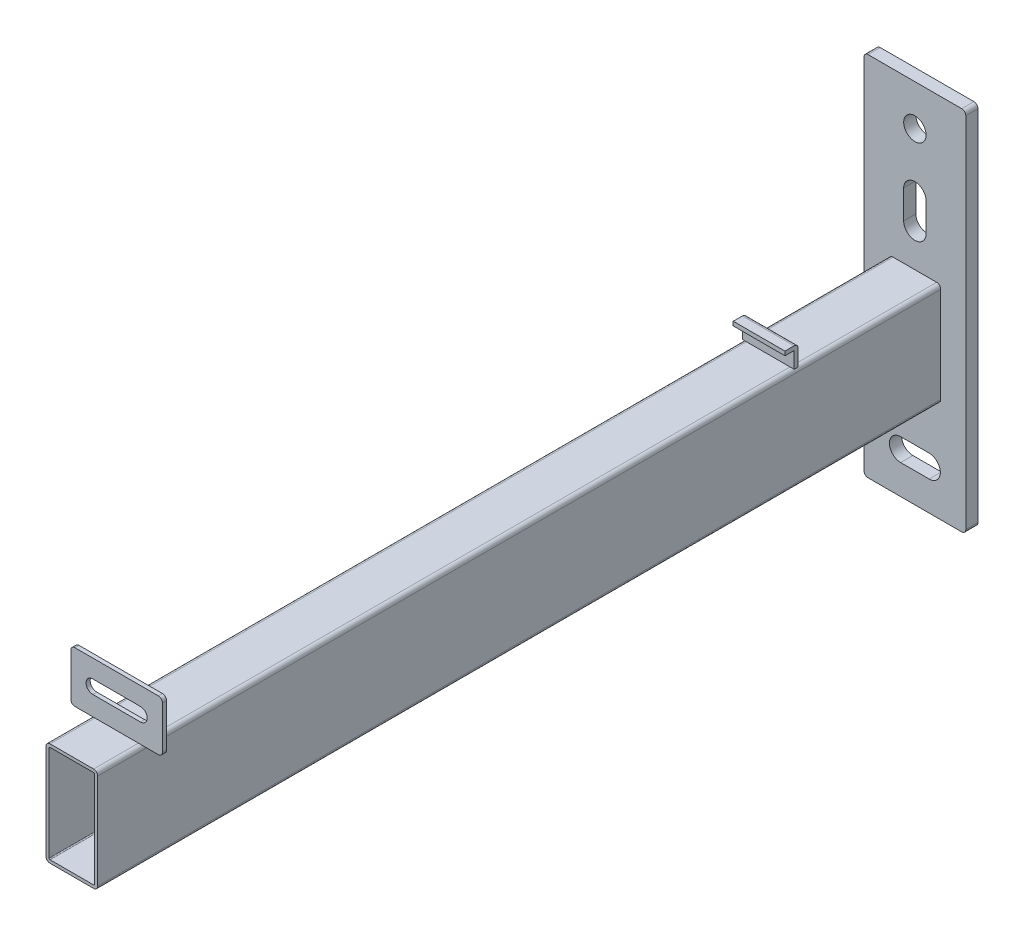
ISO-10303-21;
HEADER;
FILE_DESCRIPTION(('STEP AP214'),'2;1');
FILE_NAME('part.step','',(''),(''),'','','');
FILE_SCHEMA(('AUTOMOTIVE_DESIGN { 1 0 10303 214 1 1 1 1 }'));
ENDSEC;
DATA;
#1=APPLICATION_CONTEXT('core data for automotive mechanical design processes');
#2=APPLICATION_PROTOCOL_DEFINITION('international standard','automotive_design',2000,#1);
#3=PRODUCT_CONTEXT('',#1,'mechanical');
#4=PRODUCT('Part','Part','',(#3));
#5=PRODUCT_RELATED_PRODUCT_CATEGORY('part','',(#4));
#6=PRODUCT_DEFINITION_FORMATION('','',#4);
#7=PRODUCT_DEFINITION_CONTEXT('part definition',#1,'design');
#8=PRODUCT_DEFINITION('design','',#6,#7);
#9=PRODUCT_DEFINITION_SHAPE('','',#8);
#10=(LENGTH_UNIT() NAMED_UNIT(*) SI_UNIT(.MILLI.,.METRE.));
#11=(NAMED_UNIT(*) PLANE_ANGLE_UNIT() SI_UNIT($,.RADIAN.));
#12=(NAMED_UNIT(*) SI_UNIT($,.STERADIAN.) SOLID_ANGLE_UNIT());
#13=UNCERTAINTY_MEASURE_WITH_UNIT(LENGTH_MEASURE(1.E-05),#10,'distance_accuracy_value','');
#14=(GEOMETRIC_REPRESENTATION_CONTEXT(3) GLOBAL_UNCERTAINTY_ASSIGNED_CONTEXT((#13)) GLOBAL_UNIT_ASSIGNED_CONTEXT((#10,
#11,#12)) REPRESENTATION_CONTEXT('',''));
#15=CARTESIAN_POINT('',(0.,0.,0.));
#16=DIRECTION('',(0.,0.,1.));
#17=DIRECTION('',(1.,0.,0.));
#18=AXIS2_PLACEMENT_3D('',#15,#16,#17);
#19=CARTESIAN_POINT('',(12.7,25.3999999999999,78.));
#20=DIRECTION('',(-1.,0.,0.));
#21=DIRECTION('',(0.,0.,1.));
#22=AXIS2_PLACEMENT_3D('',#19,#20,#21);
#23=PLANE('',#22);
#24=DIRECTION('',(0.,1.,0.));
#25=VECTOR('',#24,1.);
#26=CARTESIAN_POINT('',(12.7,25.3999999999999,76.));
#27=LINE('',#26,#25);
#28=CARTESIAN_POINT('',(12.7,25.3999999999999,76.));
#29=VERTEX_POINT('',#28);
#30=CARTESIAN_POINT('',(12.7,33.3999999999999,76.));
#31=VERTEX_POINT('',#30);
#32=EDGE_CURVE('E157',#29,#31,#27,.T.);
#33=ORIENTED_EDGE('',*,*,#32,.T.);
#34=CARTESIAN_POINT('',(12.7,33.3999999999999,78.));
#35=DIRECTION('',(-1.,0.,0.));
#36=DIRECTION('',(0.,0.,1.));
#37=AXIS2_PLACEMENT_3D('',#34,#35,#36);
#38=CIRCLE('',#37,2.);
#39=CARTESIAN_POINT('',(12.7,35.3999999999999,78.));
#40=VERTEX_POINT('',#39);
#41=EDGE_CURVE('E14',#31,#40,#38,.F.);
#42=ORIENTED_EDGE('',*,*,#41,.T.);
#43=DIRECTION('',(0.,0.,-1.));
#44=VECTOR('',#43,1.);
#45=CARTESIAN_POINT('',(12.7,35.3999999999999,78.));
#46=LINE('',#45,#44);
#47=CARTESIAN_POINT('',(12.7,35.3999999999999,82.5));
#48=VERTEX_POINT('',#47);
#49=EDGE_CURVE('E180',#48,#40,#46,.T.);
#50=ORIENTED_EDGE('',*,*,#49,.F.);
#51=DIRECTION('',(0.,1.,0.));
#52=VECTOR('',#51,1.);
#53=CARTESIAN_POINT('',(12.7,35.3999999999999,82.5));
#54=LINE('',#53,#52);
#55=CARTESIAN_POINT('',(12.7,33.3999999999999,82.5));
#56=VERTEX_POINT('',#55);
#57=EDGE_CURVE('E143',#56,#48,#54,.T.);
#58=ORIENTED_EDGE('',*,*,#57,.F.);
#59=DIRECTION('',(0.,0.,-1.));
#60=VECTOR('',#59,1.);
#61=CARTESIAN_POINT('',(12.7,33.3999999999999,82.5));
#62=LINE('',#61,#60);
#63=CARTESIAN_POINT('',(12.7,33.3999999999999,78.));
#64=VERTEX_POINT('',#63);
#65=EDGE_CURVE('E139',#56,#64,#62,.T.);
#66=ORIENTED_EDGE('',*,*,#65,.T.);
#67=DIRECTION('',(0.,1.,0.));
#68=VECTOR('',#67,1.);
#69=CARTESIAN_POINT('',(12.7,25.3999999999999,78.));
#70=LINE('',#69,#68);
#71=CARTESIAN_POINT('',(12.7,25.3999999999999,78.));
#72=VERTEX_POINT('',#71);
#73=EDGE_CURVE('E164',#72,#64,#70,.T.);
#74=ORIENTED_EDGE('',*,*,#73,.F.);
#75=DIRECTION('',(0.,0.,-1.));
#76=VECTOR('',#75,1.);
#77=CARTESIAN_POINT('',(12.7,25.3999999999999,78.));
#78=LINE('',#77,#76);
#79=EDGE_CURVE('E169',#72,#29,#78,.T.);
#80=ORIENTED_EDGE('',*,*,#79,.T.);
#81=EDGE_LOOP('',(#33,#42,#50,#58,#66,#74,#80));
#82=FACE_BOUND('',#81,.T.);
#83=ADVANCED_FACE('F74',(#82),#23,.F.);
#84=CARTESIAN_POINT('',(12.7,35.3999999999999,78.));
#85=DIRECTION('',(0.,-1.,0.));
#86=DIRECTION('',(0.,0.,-1.));
#87=AXIS2_PLACEMENT_3D('',#84,#85,#86);
#88=PLANE('',#87);
#89=ORIENTED_EDGE('',*,*,#49,.T.);
#90=DIRECTION('',(-1.,0.,0.));
#91=VECTOR('',#90,1.);
#92=CARTESIAN_POINT('',(12.7,35.3999999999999,78.));
#93=LINE('',#92,#91);
#94=CARTESIAN_POINT('',(-12.7,35.3999999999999,78.));
#95=VERTEX_POINT('',#94);
#96=EDGE_CURVE('E183',#40,#95,#93,.T.);
#97=ORIENTED_EDGE('',*,*,#96,.T.);
#98=DIRECTION('',(0.,0.,-1.));
#99=VECTOR('',#98,1.);
#100=CARTESIAN_POINT('',(-12.7,35.3999999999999,78.));
#101=LINE('',#100,#99);
#102=CARTESIAN_POINT('',(-12.7,35.3999999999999,82.5));
#103=VERTEX_POINT('',#102);
#104=EDGE_CURVE('E178',#103,#95,#101,.T.);
#105=ORIENTED_EDGE('',*,*,#104,.F.);
#106=DIRECTION('',(-1.,0.,0.));
#107=VECTOR('',#106,1.);
#108=CARTESIAN_POINT('',(-12.7,35.3999999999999,82.5));
#109=LINE('',#108,#107);
#110=EDGE_CURVE('E150',#48,#103,#109,.T.);
#111=ORIENTED_EDGE('',*,*,#110,.F.);
#112=EDGE_LOOP('',(#89,#97,#105,#111));
#113=FACE_BOUND('',#112,.T.);
#114=ADVANCED_FACE('F188',(#113),#88,.F.);
#115=CARTESIAN_POINT('',(-12.7,25.3999999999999,78.));
#116=DIRECTION('',(1.,0.,0.));
#117=DIRECTION('',(0.,0.,-1.));
#118=AXIS2_PLACEMENT_3D('',#115,#116,#117);
#119=PLANE('',#118);
#120=ORIENTED_EDGE('',*,*,#104,.T.);
#121=CARTESIAN_POINT('',(-12.7,33.3999999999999,78.));
#122=DIRECTION('',(1.,0.,0.));
#123=DIRECTION('',(0.,0.,-1.));
#124=AXIS2_PLACEMENT_3D('',#121,#122,#123);
#125=CIRCLE('',#124,2.);
#126=CARTESIAN_POINT('',(-12.7,33.3999999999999,76.));
#127=VERTEX_POINT('',#126);
#128=EDGE_CURVE('E96',#95,#127,#125,.F.);
#129=ORIENTED_EDGE('',*,*,#128,.T.);
#130=DIRECTION('',(0.,-1.,0.));
#131=VECTOR('',#130,1.);
#132=CARTESIAN_POINT('',(-12.7,25.3999999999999,76.));
#133=LINE('',#132,#131);
#134=CARTESIAN_POINT('',(-12.7,25.3999999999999,76.));
#135=VERTEX_POINT('',#134);
#136=EDGE_CURVE('E159',#127,#135,#133,.T.);
#137=ORIENTED_EDGE('',*,*,#136,.T.);
#138=DIRECTION('',(0.,0.,-1.));
#139=VECTOR('',#138,1.);
#140=CARTESIAN_POINT('',(-12.7,25.3999999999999,78.));
#141=LINE('',#140,#139);
#142=CARTESIAN_POINT('',(-12.7,25.3999999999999,78.));
#143=VERTEX_POINT('',#142);
#144=EDGE_CURVE('E175',#143,#135,#141,.T.);
#145=ORIENTED_EDGE('',*,*,#144,.F.);
#146=DIRECTION('',(0.,-1.,0.));
#147=VECTOR('',#146,1.);
#148=CARTESIAN_POINT('',(-12.7,25.3999999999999,78.));
#149=LINE('',#148,#147);
#150=CARTESIAN_POINT('',(-12.7,33.3999999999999,78.));
#151=VERTEX_POINT('',#150);
#152=EDGE_CURVE('E156',#151,#143,#149,.T.);
#153=ORIENTED_EDGE('',*,*,#152,.F.);
#154=DIRECTION('',(0.,0.,-1.));
#155=VECTOR('',#154,1.);
#156=CARTESIAN_POINT('',(-12.7,33.3999999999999,82.5));
#157=LINE('',#156,#155);
#158=CARTESIAN_POINT('',(-12.7,33.3999999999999,82.5));
#159=VERTEX_POINT('',#158);
#160=EDGE_CURVE('E137',#159,#151,#157,.T.);
#161=ORIENTED_EDGE('',*,*,#160,.F.);
#162=DIRECTION('',(0.,-1.,0.));
#163=VECTOR('',#162,1.);
#164=CARTESIAN_POINT('',(-12.7,35.3999999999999,82.5));
#165=LINE('',#164,#163);
#166=EDGE_CURVE('E144',#103,#159,#165,.T.);
#167=ORIENTED_EDGE('',*,*,#166,.F.);
#168=EDGE_LOOP('',(#120,#129,#137,#145,#153,#161,#167));
#169=FACE_BOUND('',#168,.T.);
#170=ADVANCED_FACE('F154',(#169),#119,.F.);
#171=CARTESIAN_POINT('',(12.7,25.3999999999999,78.));
#172=DIRECTION('',(0.,1.,0.));
#173=DIRECTION('',(-1.,0.,0.));
#174=AXIS2_PLACEMENT_3D('',#171,#172,#173);
#175=PLANE('',#174);
#176=DIRECTION('',(1.,0.,0.));
#177=VECTOR('',#176,1.);
#178=CARTESIAN_POINT('',(12.7,25.3999999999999,76.));
#179=LINE('',#178,#177);
#180=EDGE_CURVE('E166',#135,#29,#179,.T.);
#181=ORIENTED_EDGE('',*,*,#180,.T.);
#182=ORIENTED_EDGE('',*,*,#79,.F.);
#183=DIRECTION('',(1.,0.,0.));
#184=VECTOR('',#183,1.);
#185=CARTESIAN_POINT('',(12.7,25.3999999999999,78.));
#186=LINE('',#185,#184);
#187=EDGE_CURVE('E168',#143,#72,#186,.T.);
#188=ORIENTED_EDGE('',*,*,#187,.F.);
#189=ORIENTED_EDGE('',*,*,#144,.T.);
#190=EDGE_LOOP('',(#181,#182,#188,#189));
#191=FACE_BOUND('',#190,.T.);
#192=ADVANCED_FACE('F197',(#191),#175,.F.);
#193=CARTESIAN_POINT('',(0.,0.,78.));
#194=DIRECTION('',(0.,0.,1.));
#195=DIRECTION('',(1.,0.,0.));
#196=AXIS2_PLACEMENT_3D('',#193,#194,#195);
#197=PLANE('',#196);
#198=DIRECTION('',(1.,0.,0.));
#199=VECTOR('',#198,1.);
#200=CARTESIAN_POINT('',(-12.7,33.3999999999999,78.));
#201=LINE('',#200,#199);
#202=EDGE_CURVE('E151',#151,#64,#201,.T.);
#203=ORIENTED_EDGE('',*,*,#202,.F.);
#204=ORIENTED_EDGE('',*,*,#152,.T.);
#205=ORIENTED_EDGE('',*,*,#187,.T.);
#206=ORIENTED_EDGE('',*,*,#73,.T.);
#207=EDGE_LOOP('',(#203,#204,#205,#206));
#208=FACE_BOUND('',#207,.T.);
#209=ADVANCED_FACE('F200',(#208),#197,.T.);
#210=CARTESIAN_POINT('',(0.,0.,76.));
#211=DIRECTION('',(0.,0.,1.));
#212=DIRECTION('',(1.,0.,0.));
#213=AXIS2_PLACEMENT_3D('',#210,#211,#212);
#214=PLANE('',#213);
#215=ORIENTED_EDGE('',*,*,#136,.F.);
#216=DIRECTION('',(-1.,0.,0.));
#217=VECTOR('',#216,1.);
#218=CARTESIAN_POINT('',(0.,33.3999999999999,76.));
#219=LINE('',#218,#217);
#220=EDGE_CURVE('E82',#127,#31,#219,.F.);
#221=ORIENTED_EDGE('',*,*,#220,.T.);
#222=ORIENTED_EDGE('',*,*,#32,.F.);
#223=ORIENTED_EDGE('',*,*,#180,.F.);
#224=EDGE_LOOP('',(#215,#221,#222,#223));
#225=FACE_BOUND('',#224,.T.);
#226=ADVANCED_FACE('F195',(#225),#214,.F.);
#227=CARTESIAN_POINT('',(-12.7,33.3999999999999,82.5));
#228=DIRECTION('',(0.,1.,0.));
#229=DIRECTION('',(0.,0.,1.));
#230=AXIS2_PLACEMENT_3D('',#227,#228,#229);
#231=PLANE('',#230);
#232=ORIENTED_EDGE('',*,*,#202,.T.);
#233=ORIENTED_EDGE('',*,*,#65,.F.);
#234=DIRECTION('',(1.,0.,0.));
#235=VECTOR('',#234,1.);
#236=CARTESIAN_POINT('',(-12.7,33.3999999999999,82.5));
#237=LINE('',#236,#235);
#238=EDGE_CURVE('E132',#159,#56,#237,.T.);
#239=ORIENTED_EDGE('',*,*,#238,.F.);
#240=ORIENTED_EDGE('',*,*,#160,.T.);
#241=EDGE_LOOP('',(#232,#233,#239,#240));
#242=FACE_BOUND('',#241,.T.);
#243=ADVANCED_FACE('F135',(#242),#231,.F.);
#244=CARTESIAN_POINT('',(0.,0.,82.5));
#245=DIRECTION('',(0.,0.,1.));
#246=DIRECTION('',(1.,0.,0.));
#247=AXIS2_PLACEMENT_3D('',#244,#245,#246);
#248=PLANE('',#247);
#249=ORIENTED_EDGE('',*,*,#166,.T.);
#250=ORIENTED_EDGE('',*,*,#238,.T.);
#251=ORIENTED_EDGE('',*,*,#57,.T.);
#252=ORIENTED_EDGE('',*,*,#110,.T.);
#253=EDGE_LOOP('',(#249,#250,#251,#252));
#254=FACE_BOUND('',#253,.T.);
#255=ADVANCED_FACE('F148',(#254),#248,.T.);
#256=CARTESIAN_POINT('',(12.7,33.3999999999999,78.));
#257=DIRECTION('',(-1.,0.,0.));
#258=DIRECTION('',(0.,0.,1.));
#259=AXIS2_PLACEMENT_3D('',#256,#257,#258);
#260=CYLINDRICAL_SURFACE('',#259,2.);
#261=ORIENTED_EDGE('',*,*,#41,.F.);
#262=ORIENTED_EDGE('',*,*,#220,.F.);
#263=ORIENTED_EDGE('',*,*,#128,.F.);
#264=ORIENTED_EDGE('',*,*,#96,.F.);
#265=EDGE_LOOP('',(#261,#262,#263,#264));
#266=FACE_BOUND('',#265,.T.);
#267=ADVANCED_FACE('F76',(#266),#260,.T.);
#268=CLOSED_SHELL('',(#83,#114,#170,#192,#209,#226,#243,#255,#267));
#269=MANIFOLD_SOLID_BREP('B2',#268);
#270=CARTESIAN_POINT('',(-20.5,27.3999999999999,398.));
#271=DIRECTION('',(0.,0.,1.));
#272=DIRECTION('',(1.,0.,0.));
#273=AXIS2_PLACEMENT_3D('',#270,#271,#272);
#274=PLANE('',#273);
#275=CARTESIAN_POINT('',(-20.5,27.3999999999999,398.));
#276=DIRECTION('',(0.,0.,1.));
#277=DIRECTION('',(1.,0.,0.));
#278=AXIS2_PLACEMENT_3D('',#275,#276,#277);
#279=CIRCLE('',#278,2.);
#280=CARTESIAN_POINT('',(-22.5,27.3999999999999,398.));
#281=VERTEX_POINT('',#280);
#282=CARTESIAN_POINT('',(-20.5,25.3999999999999,398.));
#283=VERTEX_POINT('',#282);
#284=EDGE_CURVE('E419',#281,#283,#279,.T.);
#285=ORIENTED_EDGE('',*,*,#284,.T.);
#286=DIRECTION('',(1.,0.,0.));
#287=VECTOR('',#286,1.);
#288=CARTESIAN_POINT('',(-20.5,25.3999999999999,398.));
#289=LINE('',#288,#287);
#290=CARTESIAN_POINT('',(20.5,25.3999999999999,398.));
#291=VERTEX_POINT('',#290);
#292=EDGE_CURVE('E422',#283,#291,#289,.T.);
#293=ORIENTED_EDGE('',*,*,#292,.T.);
#294=CARTESIAN_POINT('',(20.5,27.3999999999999,398.));
#295=DIRECTION('',(0.,0.,1.));
#296=DIRECTION('',(1.,0.,0.));
#297=AXIS2_PLACEMENT_3D('',#294,#295,#296);
#298=CIRCLE('',#297,2.);
#299=CARTESIAN_POINT('',(22.5,27.3999999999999,398.));
#300=VERTEX_POINT('',#299);
#301=EDGE_CURVE('E425',#291,#300,#298,.T.);
#302=ORIENTED_EDGE('',*,*,#301,.T.);
#303=DIRECTION('',(0.,1.,0.));
#304=VECTOR('',#303,1.);
#305=CARTESIAN_POINT('',(22.5,27.3999999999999,398.));
#306=LINE('',#305,#304);
#307=CARTESIAN_POINT('',(22.5,48.3999999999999,398.));
#308=VERTEX_POINT('',#307);
#309=EDGE_CURVE('E427',#300,#308,#306,.T.);
#310=ORIENTED_EDGE('',*,*,#309,.T.);
#311=CARTESIAN_POINT('',(20.5,48.3999999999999,398.));
#312=DIRECTION('',(0.,0.,1.));
#313=DIRECTION('',(1.,0.,0.));
#314=AXIS2_PLACEMENT_3D('',#311,#312,#313);
#315=CIRCLE('',#314,2.);
#316=CARTESIAN_POINT('',(20.5,50.3999999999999,398.));
#317=VERTEX_POINT('',#316);
#318=EDGE_CURVE('E429',#308,#317,#315,.T.);
#319=ORIENTED_EDGE('',*,*,#318,.T.);
#320=DIRECTION('',(-1.,0.,0.));
#321=VECTOR('',#320,1.);
#322=CARTESIAN_POINT('',(20.5,50.3999999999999,398.));
#323=LINE('',#322,#321);
#324=CARTESIAN_POINT('',(-20.5,50.3999999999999,398.));
#325=VERTEX_POINT('',#324);
#326=EDGE_CURVE('E431',#317,#325,#323,.T.);
#327=ORIENTED_EDGE('',*,*,#326,.T.);
#328=CARTESIAN_POINT('',(-20.5,48.3999999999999,398.));
#329=DIRECTION('',(0.,0.,1.));
#330=DIRECTION('',(1.,0.,0.));
#331=AXIS2_PLACEMENT_3D('',#328,#329,#330);
#332=CIRCLE('',#331,2.);
#333=CARTESIAN_POINT('',(-22.5,48.3999999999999,398.));
#334=VERTEX_POINT('',#333);
#335=EDGE_CURVE('E433',#325,#334,#332,.T.);
#336=ORIENTED_EDGE('',*,*,#335,.T.);
#337=DIRECTION('',(0.,-1.,0.));
#338=VECTOR('',#337,1.);
#339=CARTESIAN_POINT('',(-22.5,48.3999999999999,398.));
#340=LINE('',#339,#338);
#341=EDGE_CURVE('E435',#334,#281,#340,.T.);
#342=ORIENTED_EDGE('',*,*,#341,.T.);
#343=EDGE_LOOP('',(#285,#293,#302,#310,#319,#327,#336,#342));
#344=FACE_BOUND('',#343,.T.);
#345=DIRECTION('',(1.,0.,0.));
#346=VECTOR('',#345,1.);
#347=CARTESIAN_POINT('',(-11.7,34.8999999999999,398.));
#348=LINE('',#347,#346);
#349=CARTESIAN_POINT('',(-11.7,34.8999999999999,398.));
#350=VERTEX_POINT('',#349);
#351=CARTESIAN_POINT('',(11.7,34.8999999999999,398.));
#352=VERTEX_POINT('',#351);
#353=EDGE_CURVE('E391',#350,#352,#348,.T.);
#354=ORIENTED_EDGE('',*,*,#353,.F.);
#355=CARTESIAN_POINT('',(-11.7,38.1999999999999,398.));
#356=DIRECTION('',(0.,0.,1.));
#357=DIRECTION('',(1.,0.,0.));
#358=AXIS2_PLACEMENT_3D('',#355,#356,#357);
#359=CIRCLE('',#358,3.3);
#360=CARTESIAN_POINT('',(-11.7,41.4999999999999,398.));
#361=VERTEX_POINT('',#360);
#362=EDGE_CURVE('E383',#361,#350,#359,.T.);
#363=ORIENTED_EDGE('',*,*,#362,.F.);
#364=DIRECTION('',(-1.,0.,0.));
#365=VECTOR('',#364,1.);
#366=CARTESIAN_POINT('',(11.7,41.4999999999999,398.));
#367=LINE('',#366,#365);
#368=CARTESIAN_POINT('',(11.7,41.4999999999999,398.));
#369=VERTEX_POINT('',#368);
#370=EDGE_CURVE('E405',#369,#361,#367,.T.);
#371=ORIENTED_EDGE('',*,*,#370,.F.);
#372=CARTESIAN_POINT('',(11.7,38.1999999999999,398.));
#373=DIRECTION('',(0.,0.,1.));
#374=DIRECTION('',(1.,0.,0.));
#375=AXIS2_PLACEMENT_3D('',#372,#373,#374);
#376=CIRCLE('',#375,3.3);
#377=EDGE_CURVE('E403',#352,#369,#376,.T.);
#378=ORIENTED_EDGE('',*,*,#377,.F.);
#379=EDGE_LOOP('',(#354,#363,#371,#378));
#380=FACE_BOUND('',#379,.T.);
#381=ADVANCED_FACE('F294',(#344,#380),#274,.T.);
#382=CARTESIAN_POINT('',(-20.5,27.3999999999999,396.));
#383=DIRECTION('',(0.,0.,1.));
#384=DIRECTION('',(1.,0.,0.));
#385=AXIS2_PLACEMENT_3D('',#382,#383,#384);
#386=PLANE('',#385);
#387=CARTESIAN_POINT('',(-20.5,27.3999999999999,396.));
#388=DIRECTION('',(0.,0.,1.));
#389=DIRECTION('',(1.,0.,0.));
#390=AXIS2_PLACEMENT_3D('',#387,#388,#389);
#391=CIRCLE('',#390,2.);
#392=CARTESIAN_POINT('',(-22.5,27.3999999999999,396.));
#393=VERTEX_POINT('',#392);
#394=CARTESIAN_POINT('',(-20.5,25.3999999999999,396.));
#395=VERTEX_POINT('',#394);
#396=EDGE_CURVE('E399',#393,#395,#391,.T.);
#397=ORIENTED_EDGE('',*,*,#396,.F.);
#398=DIRECTION('',(0.,-1.,0.));
#399=VECTOR('',#398,1.);
#400=CARTESIAN_POINT('',(-22.5,48.3999999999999,396.));
#401=LINE('',#400,#399);
#402=CARTESIAN_POINT('',(-22.5,48.3999999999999,396.));
#403=VERTEX_POINT('',#402);
#404=EDGE_CURVE('E423',#403,#393,#401,.T.);
#405=ORIENTED_EDGE('',*,*,#404,.F.);
#406=CARTESIAN_POINT('',(-20.5,48.3999999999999,396.));
#407=DIRECTION('',(0.,0.,1.));
#408=DIRECTION('',(1.,0.,0.));
#409=AXIS2_PLACEMENT_3D('',#406,#407,#408);
#410=CIRCLE('',#409,2.);
#411=CARTESIAN_POINT('',(-20.5,50.3999999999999,396.));
#412=VERTEX_POINT('',#411);
#413=EDGE_CURVE('E450',#412,#403,#410,.T.);
#414=ORIENTED_EDGE('',*,*,#413,.F.);
#415=DIRECTION('',(-1.,0.,0.));
#416=VECTOR('',#415,1.);
#417=CARTESIAN_POINT('',(20.5,50.3999999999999,396.));
#418=LINE('',#417,#416);
#419=CARTESIAN_POINT('',(20.5,50.3999999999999,396.));
#420=VERTEX_POINT('',#419);
#421=EDGE_CURVE('E448',#420,#412,#418,.T.);
#422=ORIENTED_EDGE('',*,*,#421,.F.);
#423=CARTESIAN_POINT('',(20.5,48.3999999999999,396.));
#424=DIRECTION('',(0.,0.,1.));
#425=DIRECTION('',(1.,0.,0.));
#426=AXIS2_PLACEMENT_3D('',#423,#424,#425);
#427=CIRCLE('',#426,2.);
#428=CARTESIAN_POINT('',(22.5,48.3999999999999,396.));
#429=VERTEX_POINT('',#428);
#430=EDGE_CURVE('E446',#429,#420,#427,.T.);
#431=ORIENTED_EDGE('',*,*,#430,.F.);
#432=DIRECTION('',(0.,1.,0.));
#433=VECTOR('',#432,1.);
#434=CARTESIAN_POINT('',(22.5,27.3999999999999,396.));
#435=LINE('',#434,#433);
#436=CARTESIAN_POINT('',(22.5,27.3999999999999,396.));
#437=VERTEX_POINT('',#436);
#438=EDGE_CURVE('E444',#437,#429,#435,.T.);
#439=ORIENTED_EDGE('',*,*,#438,.F.);
#440=CARTESIAN_POINT('',(20.5,27.3999999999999,396.));
#441=DIRECTION('',(0.,0.,1.));
#442=DIRECTION('',(1.,0.,0.));
#443=AXIS2_PLACEMENT_3D('',#440,#441,#442);
#444=CIRCLE('',#443,2.);
#445=CARTESIAN_POINT('',(20.5,25.3999999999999,396.));
#446=VERTEX_POINT('',#445);
#447=EDGE_CURVE('E442',#446,#437,#444,.T.);
#448=ORIENTED_EDGE('',*,*,#447,.F.);
#449=DIRECTION('',(1.,0.,0.));
#450=VECTOR('',#449,1.);
#451=CARTESIAN_POINT('',(-20.5,25.3999999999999,396.));
#452=LINE('',#451,#450);
#453=EDGE_CURVE('E440',#395,#446,#452,.T.);
#454=ORIENTED_EDGE('',*,*,#453,.F.);
#455=EDGE_LOOP('',(#397,#405,#414,#422,#431,#439,#448,#454));
#456=FACE_BOUND('',#455,.T.);
#457=CARTESIAN_POINT('',(-11.7,38.1999999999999,396.));
#458=DIRECTION('',(0.,0.,1.));
#459=DIRECTION('',(1.,0.,0.));
#460=AXIS2_PLACEMENT_3D('',#457,#458,#459);
#461=CIRCLE('',#460,3.3);
#462=CARTESIAN_POINT('',(-11.7,41.4999999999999,396.));
#463=VERTEX_POINT('',#462);
#464=CARTESIAN_POINT('',(-11.7,34.8999999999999,396.));
#465=VERTEX_POINT('',#464);
#466=EDGE_CURVE('E317',#463,#465,#461,.T.);
#467=ORIENTED_EDGE('',*,*,#466,.T.);
#468=DIRECTION('',(1.,0.,0.));
#469=VECTOR('',#468,1.);
#470=CARTESIAN_POINT('',(-11.7,34.8999999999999,396.));
#471=LINE('',#470,#469);
#472=CARTESIAN_POINT('',(11.7,34.8999999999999,396.));
#473=VERTEX_POINT('',#472);
#474=EDGE_CURVE('E398',#465,#473,#471,.T.);
#475=ORIENTED_EDGE('',*,*,#474,.T.);
#476=CARTESIAN_POINT('',(11.7,38.1999999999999,396.));
#477=DIRECTION('',(0.,0.,1.));
#478=DIRECTION('',(1.,0.,0.));
#479=AXIS2_PLACEMENT_3D('',#476,#477,#478);
#480=CIRCLE('',#479,3.3);
#481=CARTESIAN_POINT('',(11.7,41.4999999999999,396.));
#482=VERTEX_POINT('',#481);
#483=EDGE_CURVE('E411',#473,#482,#480,.T.);
#484=ORIENTED_EDGE('',*,*,#483,.T.);
#485=DIRECTION('',(-1.,0.,0.));
#486=VECTOR('',#485,1.);
#487=CARTESIAN_POINT('',(11.7,41.4999999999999,396.));
#488=LINE('',#487,#486);
#489=EDGE_CURVE('E392',#482,#463,#488,.T.);
#490=ORIENTED_EDGE('',*,*,#489,.T.);
#491=EDGE_LOOP('',(#467,#475,#484,#490));
#492=FACE_BOUND('',#491,.T.);
#493=ADVANCED_FACE('F480',(#456,#492),#386,.F.);
#494=CARTESIAN_POINT('',(-20.5,27.3999999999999,398.));
#495=DIRECTION('',(0.,0.,-1.));
#496=DIRECTION('',(-1.,0.,0.));
#497=AXIS2_PLACEMENT_3D('',#494,#495,#496);
#498=CYLINDRICAL_SURFACE('',#497,2.);
#499=ORIENTED_EDGE('',*,*,#396,.T.);
#500=DIRECTION('',(0.,0.,-1.));
#501=VECTOR('',#500,1.);
#502=CARTESIAN_POINT('',(-20.5,25.3999999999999,398.));
#503=LINE('',#502,#501);
#504=EDGE_CURVE('E72',#283,#395,#503,.T.);
#505=ORIENTED_EDGE('',*,*,#504,.F.);
#506=ORIENTED_EDGE('',*,*,#284,.F.);
#507=DIRECTION('',(0.,0.,-1.));
#508=VECTOR('',#507,1.);
#509=CARTESIAN_POINT('',(-22.5,27.3999999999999,398.));
#510=LINE('',#509,#508);
#511=EDGE_CURVE('E437',#281,#393,#510,.T.);
#512=ORIENTED_EDGE('',*,*,#511,.T.);
#513=EDGE_LOOP('',(#499,#505,#506,#512));
#514=FACE_BOUND('',#513,.T.);
#515=ADVANCED_FACE('F296',(#514),#498,.T.);
#516=CARTESIAN_POINT('',(-20.5,25.3999999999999,398.));
#517=DIRECTION('',(0.,1.,0.));
#518=DIRECTION('',(0.,0.,1.));
#519=AXIS2_PLACEMENT_3D('',#516,#517,#518);
#520=PLANE('',#519);
#521=ORIENTED_EDGE('',*,*,#453,.T.);
#522=DIRECTION('',(0.,0.,-1.));
#523=VECTOR('',#522,1.);
#524=CARTESIAN_POINT('',(20.5,25.3999999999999,398.));
#525=LINE('',#524,#523);
#526=EDGE_CURVE('E302',#291,#446,#525,.T.);
#527=ORIENTED_EDGE('',*,*,#526,.F.);
#528=ORIENTED_EDGE('',*,*,#292,.F.);
#529=ORIENTED_EDGE('',*,*,#504,.T.);
#530=EDGE_LOOP('',(#521,#527,#528,#529));
#531=FACE_BOUND('',#530,.T.);
#532=ADVANCED_FACE('F497',(#531),#520,.F.);
#533=CARTESIAN_POINT('',(20.5,27.3999999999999,398.));
#534=DIRECTION('',(0.,0.,-1.));
#535=DIRECTION('',(-1.,0.,0.));
#536=AXIS2_PLACEMENT_3D('',#533,#534,#535);
#537=CYLINDRICAL_SURFACE('',#536,2.);
#538=ORIENTED_EDGE('',*,*,#447,.T.);
#539=DIRECTION('',(0.,0.,-1.));
#540=VECTOR('',#539,1.);
#541=CARTESIAN_POINT('',(22.5,27.3999999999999,398.));
#542=LINE('',#541,#540);
#543=EDGE_CURVE('E467',#300,#437,#542,.T.);
#544=ORIENTED_EDGE('',*,*,#543,.F.);
#545=ORIENTED_EDGE('',*,*,#301,.F.);
#546=ORIENTED_EDGE('',*,*,#526,.T.);
#547=EDGE_LOOP('',(#538,#544,#545,#546));
#548=FACE_BOUND('',#547,.T.);
#549=ADVANCED_FACE('F474',(#548),#537,.T.);
#550=CARTESIAN_POINT('',(22.5,27.3999999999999,398.));
#551=DIRECTION('',(-1.,0.,0.));
#552=DIRECTION('',(0.,-1.,0.));
#553=AXIS2_PLACEMENT_3D('',#550,#551,#552);
#554=PLANE('',#553);
#555=ORIENTED_EDGE('',*,*,#438,.T.);
#556=DIRECTION('',(0.,0.,-1.));
#557=VECTOR('',#556,1.);
#558=CARTESIAN_POINT('',(22.5,48.3999999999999,398.));
#559=LINE('',#558,#557);
#560=EDGE_CURVE('E464',#308,#429,#559,.T.);
#561=ORIENTED_EDGE('',*,*,#560,.F.);
#562=ORIENTED_EDGE('',*,*,#309,.F.);
#563=ORIENTED_EDGE('',*,*,#543,.T.);
#564=EDGE_LOOP('',(#555,#561,#562,#563));
#565=FACE_BOUND('',#564,.T.);
#566=ADVANCED_FACE('F486',(#565),#554,.F.);
#567=CARTESIAN_POINT('',(20.5,48.3999999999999,398.));
#568=DIRECTION('',(0.,0.,-1.));
#569=DIRECTION('',(-1.,0.,0.));
#570=AXIS2_PLACEMENT_3D('',#567,#568,#569);
#571=CYLINDRICAL_SURFACE('',#570,2.);
#572=ORIENTED_EDGE('',*,*,#430,.T.);
#573=DIRECTION('',(0.,0.,-1.));
#574=VECTOR('',#573,1.);
#575=CARTESIAN_POINT('',(20.5,50.3999999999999,398.));
#576=LINE('',#575,#574);
#577=EDGE_CURVE('E461',#317,#420,#576,.T.);
#578=ORIENTED_EDGE('',*,*,#577,.F.);
#579=ORIENTED_EDGE('',*,*,#318,.F.);
#580=ORIENTED_EDGE('',*,*,#560,.T.);
#581=EDGE_LOOP('',(#572,#578,#579,#580));
#582=FACE_BOUND('',#581,.T.);
#583=ADVANCED_FACE('F490',(#582),#571,.T.);
#584=CARTESIAN_POINT('',(20.5,50.3999999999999,398.));
#585=DIRECTION('',(0.,-1.,0.));
#586=DIRECTION('',(0.,0.,-1.));
#587=AXIS2_PLACEMENT_3D('',#584,#585,#586);
#588=PLANE('',#587);
#589=ORIENTED_EDGE('',*,*,#421,.T.);
#590=DIRECTION('',(0.,0.,-1.));
#591=VECTOR('',#590,1.);
#592=CARTESIAN_POINT('',(-20.5,50.3999999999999,398.));
#593=LINE('',#592,#591);
#594=EDGE_CURVE('E458',#325,#412,#593,.T.);
#595=ORIENTED_EDGE('',*,*,#594,.F.);
#596=ORIENTED_EDGE('',*,*,#326,.F.);
#597=ORIENTED_EDGE('',*,*,#577,.T.);
#598=EDGE_LOOP('',(#589,#595,#596,#597));
#599=FACE_BOUND('',#598,.T.);
#600=ADVANCED_FACE('F510',(#599),#588,.F.);
#601=CARTESIAN_POINT('',(-20.5,48.3999999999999,398.));
#602=DIRECTION('',(0.,0.,-1.));
#603=DIRECTION('',(-1.,0.,0.));
#604=AXIS2_PLACEMENT_3D('',#601,#602,#603);
#605=CYLINDRICAL_SURFACE('',#604,2.);
#606=ORIENTED_EDGE('',*,*,#413,.T.);
#607=DIRECTION('',(0.,0.,-1.));
#608=VECTOR('',#607,1.);
#609=CARTESIAN_POINT('',(-22.5,48.3999999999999,398.));
#610=LINE('',#609,#608);
#611=EDGE_CURVE('E455',#334,#403,#610,.T.);
#612=ORIENTED_EDGE('',*,*,#611,.F.);
#613=ORIENTED_EDGE('',*,*,#335,.F.);
#614=ORIENTED_EDGE('',*,*,#594,.T.);
#615=EDGE_LOOP('',(#606,#612,#613,#614));
#616=FACE_BOUND('',#615,.T.);
#617=ADVANCED_FACE('F508',(#616),#605,.T.);
#618=CARTESIAN_POINT('',(-22.5,48.3999999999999,398.));
#619=DIRECTION('',(1.,0.,0.));
#620=DIRECTION('',(0.,1.,0.));
#621=AXIS2_PLACEMENT_3D('',#618,#619,#620);
#622=PLANE('',#621);
#623=ORIENTED_EDGE('',*,*,#404,.T.);
#624=ORIENTED_EDGE('',*,*,#511,.F.);
#625=ORIENTED_EDGE('',*,*,#341,.F.);
#626=ORIENTED_EDGE('',*,*,#611,.T.);
#627=EDGE_LOOP('',(#623,#624,#625,#626));
#628=FACE_BOUND('',#627,.T.);
#629=ADVANCED_FACE('F503',(#628),#622,.F.);
#630=CARTESIAN_POINT('',(-11.7,38.1999999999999,398.));
#631=DIRECTION('',(0.,0.,-1.));
#632=DIRECTION('',(-1.,0.,0.));
#633=AXIS2_PLACEMENT_3D('',#630,#631,#632);
#634=CYLINDRICAL_SURFACE('',#633,3.3);
#635=ORIENTED_EDGE('',*,*,#466,.F.);
#636=DIRECTION('',(0.,0.,-1.));
#637=VECTOR('',#636,1.);
#638=CARTESIAN_POINT('',(-11.7,41.4999999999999,398.));
#639=LINE('',#638,#637);
#640=EDGE_CURVE('E387',#361,#463,#639,.T.);
#641=ORIENTED_EDGE('',*,*,#640,.F.);
#642=ORIENTED_EDGE('',*,*,#362,.T.);
#643=DIRECTION('',(0.,0.,-1.));
#644=VECTOR('',#643,1.);
#645=CARTESIAN_POINT('',(-11.7,34.8999999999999,398.));
#646=LINE('',#645,#644);
#647=EDGE_CURVE('E386',#350,#465,#646,.T.);
#648=ORIENTED_EDGE('',*,*,#647,.T.);
#649=EDGE_LOOP('',(#635,#641,#642,#648));
#650=FACE_BOUND('',#649,.T.);
#651=ADVANCED_FACE('F385',(#650),#634,.F.);
#652=CARTESIAN_POINT('',(-11.7,34.8999999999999,398.));
#653=DIRECTION('',(0.,1.,0.));
#654=DIRECTION('',(0.,0.,1.));
#655=AXIS2_PLACEMENT_3D('',#652,#653,#654);
#656=PLANE('',#655);
#657=ORIENTED_EDGE('',*,*,#474,.F.);
#658=ORIENTED_EDGE('',*,*,#647,.F.);
#659=ORIENTED_EDGE('',*,*,#353,.T.);
#660=DIRECTION('',(0.,0.,-1.));
#661=VECTOR('',#660,1.);
#662=CARTESIAN_POINT('',(11.7,34.8999999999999,398.));
#663=LINE('',#662,#661);
#664=EDGE_CURVE('E400',#352,#473,#663,.T.);
#665=ORIENTED_EDGE('',*,*,#664,.T.);
#666=EDGE_LOOP('',(#657,#658,#659,#665));
#667=FACE_BOUND('',#666,.T.);
#668=ADVANCED_FACE('F395',(#667),#656,.T.);
#669=CARTESIAN_POINT('',(11.7,38.1999999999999,398.));
#670=DIRECTION('',(0.,0.,-1.));
#671=DIRECTION('',(-1.,0.,0.));
#672=AXIS2_PLACEMENT_3D('',#669,#670,#671);
#673=CYLINDRICAL_SURFACE('',#672,3.3);
#674=ORIENTED_EDGE('',*,*,#483,.F.);
#675=ORIENTED_EDGE('',*,*,#664,.F.);
#676=ORIENTED_EDGE('',*,*,#377,.T.);
#677=DIRECTION('',(0.,0.,-1.));
#678=VECTOR('',#677,1.);
#679=CARTESIAN_POINT('',(11.7,41.4999999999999,398.));
#680=LINE('',#679,#678);
#681=EDGE_CURVE('E309',#369,#482,#680,.T.);
#682=ORIENTED_EDGE('',*,*,#681,.T.);
#683=EDGE_LOOP('',(#674,#675,#676,#682));
#684=FACE_BOUND('',#683,.T.);
#685=ADVANCED_FACE('F535',(#684),#673,.F.);
#686=CARTESIAN_POINT('',(11.7,41.4999999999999,398.));
#687=DIRECTION('',(0.,-1.,0.));
#688=DIRECTION('',(0.,0.,-1.));
#689=AXIS2_PLACEMENT_3D('',#686,#687,#688);
#690=PLANE('',#689);
#691=ORIENTED_EDGE('',*,*,#489,.F.);
#692=ORIENTED_EDGE('',*,*,#681,.F.);
#693=ORIENTED_EDGE('',*,*,#370,.T.);
#694=ORIENTED_EDGE('',*,*,#640,.T.);
#695=EDGE_LOOP('',(#691,#692,#693,#694));
#696=FACE_BOUND('',#695,.T.);
#697=ADVANCED_FACE('F539',(#696),#690,.T.);
#698=CLOSED_SHELL('',(#381,#493,#515,#532,#549,#566,#583,#600,#617,#629,#651,#668,#685,#697));
#699=MANIFOLD_SOLID_BREP('B8',#698);
#700=CARTESIAN_POINT('',(-11.2,-23.4,420.));
#701=DIRECTION('',(1.,0.,0.));
#702=DIRECTION('',(0.,0.,-1.));
#703=AXIS2_PLACEMENT_3D('',#700,#701,#702);
#704=PLANE('',#703);
#705=DIRECTION('',(0.,0.,-1.));
#706=VECTOR('',#705,1.);
#707=CARTESIAN_POINT('',(-11.2,23.3999999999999,420.));
#708=LINE('',#707,#706);
#709=CARTESIAN_POINT('',(-11.2,23.3999999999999,420.));
#710=VERTEX_POINT('',#709);
#711=CARTESIAN_POINT('',(-11.2,23.4,6.00000000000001));
#712=VERTEX_POINT('',#711);
#713=EDGE_CURVE('E640',#710,#712,#708,.T.);
#714=ORIENTED_EDGE('',*,*,#713,.F.);
#715=DIRECTION('',(0.,-1.,0.));
#716=VECTOR('',#715,1.);
#717=CARTESIAN_POINT('',(-11.2,-23.4,420.));
#718=LINE('',#717,#716);
#719=CARTESIAN_POINT('',(-11.2,-23.4,420.));
#720=VERTEX_POINT('',#719);
#721=EDGE_CURVE('E655',#710,#720,#718,.T.);
#722=ORIENTED_EDGE('',*,*,#721,.T.);
#723=DIRECTION('',(0.,0.,-1.));
#724=VECTOR('',#723,1.);
#725=CARTESIAN_POINT('',(-11.2,-23.4,420.));
#726=LINE('',#725,#724);
#727=CARTESIAN_POINT('',(-11.2,-23.4000000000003,6.00000000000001));
#728=VERTEX_POINT('',#727);
#729=EDGE_CURVE('E783',#720,#728,#726,.T.);
#730=ORIENTED_EDGE('',*,*,#729,.T.);
#731=DIRECTION('',(0.,-1.,0.));
#732=VECTOR('',#731,1.);
#733=CARTESIAN_POINT('',(-11.2,-23.4,6.00000000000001));
#734=LINE('',#733,#732);
#735=EDGE_CURVE('E830',#712,#728,#734,.T.);
#736=ORIENTED_EDGE('',*,*,#735,.F.);
#737=EDGE_LOOP('',(#714,#722,#730,#736));
#738=FACE_BOUND('',#737,.T.);
#739=ADVANCED_FACE('F636',(#738),#704,.T.);
#740=CARTESIAN_POINT('',(-10.7,-23.4,420.));
#741=DIRECTION('',(0.,0.,-1.));
#742=DIRECTION('',(0.,1.,0.));
#743=AXIS2_PLACEMENT_3D('',#740,#741,#742);
#744=CYLINDRICAL_SURFACE('',#743,0.5);
#745=ORIENTED_EDGE('',*,*,#729,.F.);
#746=CARTESIAN_POINT('',(-10.7,-23.4,420.));
#747=DIRECTION('',(0.,0.,1.));
#748=DIRECTION('',(1.,0.,0.));
#749=AXIS2_PLACEMENT_3D('',#746,#747,#748);
#750=CIRCLE('',#749,0.5);
#751=CARTESIAN_POINT('',(-10.7,-23.9,420.));
#752=VERTEX_POINT('',#751);
#753=EDGE_CURVE('E782',#720,#752,#750,.T.);
#754=ORIENTED_EDGE('',*,*,#753,.T.);
#755=DIRECTION('',(0.,0.,-1.));
#756=VECTOR('',#755,1.);
#757=CARTESIAN_POINT('',(-10.7,-23.9,420.));
#758=LINE('',#757,#756);
#759=CARTESIAN_POINT('',(-10.7,-23.9,6.00000000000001));
#760=VERTEX_POINT('',#759);
#761=EDGE_CURVE('E781',#752,#760,#758,.T.);
#762=ORIENTED_EDGE('',*,*,#761,.T.);
#763=CARTESIAN_POINT('',(-10.7,-23.4,6.00000000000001));
#764=DIRECTION('',(0.,0.,1.));
#765=DIRECTION('',(1.,0.,0.));
#766=AXIS2_PLACEMENT_3D('',#763,#764,#765);
#767=CIRCLE('',#766,0.5);
#768=EDGE_CURVE('E836',#728,#760,#767,.T.);
#769=ORIENTED_EDGE('',*,*,#768,.F.);
#770=EDGE_LOOP('',(#745,#754,#762,#769));
#771=FACE_BOUND('',#770,.T.);
#772=ADVANCED_FACE('F901',(#771),#744,.F.);
#773=CARTESIAN_POINT('',(-10.7,-23.9,420.));
#774=DIRECTION('',(0.,1.,0.));
#775=DIRECTION('',(0.,0.,1.));
#776=AXIS2_PLACEMENT_3D('',#773,#774,#775);
#777=PLANE('',#776);
#778=ORIENTED_EDGE('',*,*,#761,.F.);
#779=DIRECTION('',(1.,0.,0.));
#780=VECTOR('',#779,1.);
#781=CARTESIAN_POINT('',(-10.7,-23.9,420.));
#782=LINE('',#781,#780);
#783=CARTESIAN_POINT('',(10.7,-23.9,420.));
#784=VERTEX_POINT('',#783);
#785=EDGE_CURVE('E780',#752,#784,#782,.T.);
#786=ORIENTED_EDGE('',*,*,#785,.T.);
#787=DIRECTION('',(0.,0.,-1.));
#788=VECTOR('',#787,1.);
#789=CARTESIAN_POINT('',(10.7,-23.9,420.));
#790=LINE('',#789,#788);
#791=CARTESIAN_POINT('',(10.7,-23.9,6.00000000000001));
#792=VERTEX_POINT('',#791);
#793=EDGE_CURVE('E778',#784,#792,#790,.T.);
#794=ORIENTED_EDGE('',*,*,#793,.T.);
#795=DIRECTION('',(1.,0.,0.));
#796=VECTOR('',#795,1.);
#797=CARTESIAN_POINT('',(-10.7,-23.9,6.00000000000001));
#798=LINE('',#797,#796);
#799=EDGE_CURVE('E838',#760,#792,#798,.T.);
#800=ORIENTED_EDGE('',*,*,#799,.F.);
#801=EDGE_LOOP('',(#778,#786,#794,#800));
#802=FACE_BOUND('',#801,.T.);
#803=ADVANCED_FACE('F899',(#802),#777,.T.);
#804=CARTESIAN_POINT('',(10.7,-23.4,420.));
#805=DIRECTION('',(0.,0.,-1.));
#806=DIRECTION('',(0.,1.,0.));
#807=AXIS2_PLACEMENT_3D('',#804,#805,#806);
#808=CYLINDRICAL_SURFACE('',#807,0.5);
#809=ORIENTED_EDGE('',*,*,#793,.F.);
#810=CARTESIAN_POINT('',(10.7,-23.4,420.));
#811=DIRECTION('',(0.,0.,1.));
#812=DIRECTION('',(1.,0.,0.));
#813=AXIS2_PLACEMENT_3D('',#810,#811,#812);
#814=CIRCLE('',#813,0.5);
#815=CARTESIAN_POINT('',(11.2,-23.4,420.));
#816=VERTEX_POINT('',#815);
#817=EDGE_CURVE('E777',#784,#816,#814,.T.);
#818=ORIENTED_EDGE('',*,*,#817,.T.);
#819=DIRECTION('',(0.,0.,-1.));
#820=VECTOR('',#819,1.);
#821=CARTESIAN_POINT('',(11.2,-23.4,420.));
#822=LINE('',#821,#820);
#823=CARTESIAN_POINT('',(11.2,-23.4,6.00000000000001));
#824=VERTEX_POINT('',#823);
#825=EDGE_CURVE('E775',#816,#824,#822,.T.);
#826=ORIENTED_EDGE('',*,*,#825,.T.);
#827=CARTESIAN_POINT('',(10.7,-23.4,6.00000000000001));
#828=DIRECTION('',(0.,0.,1.));
#829=DIRECTION('',(1.,0.,0.));
#830=AXIS2_PLACEMENT_3D('',#827,#828,#829);
#831=CIRCLE('',#830,0.5);
#832=EDGE_CURVE('E881',#792,#824,#831,.T.);
#833=ORIENTED_EDGE('',*,*,#832,.F.);
#834=EDGE_LOOP('',(#809,#818,#826,#833));
#835=FACE_BOUND('',#834,.T.);
#836=ADVANCED_FACE('F891',(#835),#808,.F.);
#837=CARTESIAN_POINT('',(11.2,23.3999999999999,420.));
#838=DIRECTION('',(-1.,0.,0.));
#839=DIRECTION('',(0.,0.,1.));
#840=AXIS2_PLACEMENT_3D('',#837,#838,#839);
#841=PLANE('',#840);
#842=ORIENTED_EDGE('',*,*,#825,.F.);
#843=DIRECTION('',(0.,1.,0.));
#844=VECTOR('',#843,1.);
#845=CARTESIAN_POINT('',(11.2,23.3999999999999,420.));
#846=LINE('',#845,#844);
#847=CARTESIAN_POINT('',(11.2,23.3999999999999,420.));
#848=VERTEX_POINT('',#847);
#849=EDGE_CURVE('E774',#816,#848,#846,.T.);
#850=ORIENTED_EDGE('',*,*,#849,.T.);
#851=DIRECTION('',(0.,0.,-1.));
#852=VECTOR('',#851,1.);
#853=CARTESIAN_POINT('',(11.2,23.3999999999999,420.));
#854=LINE('',#853,#852);
#855=CARTESIAN_POINT('',(11.2,23.4000000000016,6.00000000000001));
#856=VERTEX_POINT('',#855);
#857=EDGE_CURVE('E772',#848,#856,#854,.T.);
#858=ORIENTED_EDGE('',*,*,#857,.T.);
#859=DIRECTION('',(0.,1.,0.));
#860=VECTOR('',#859,1.);
#861=CARTESIAN_POINT('',(11.2,23.3999999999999,6.00000000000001));
#862=LINE('',#861,#860);
#863=EDGE_CURVE('E876',#824,#856,#862,.T.);
#864=ORIENTED_EDGE('',*,*,#863,.F.);
#865=EDGE_LOOP('',(#842,#850,#858,#864));
#866=FACE_BOUND('',#865,.T.);
#867=ADVANCED_FACE('F894',(#866),#841,.T.);
#868=CARTESIAN_POINT('',(10.7,23.3999999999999,420.));
#869=DIRECTION('',(0.,0.,-1.));
#870=DIRECTION('',(0.,1.,0.));
#871=AXIS2_PLACEMENT_3D('',#868,#869,#870);
#872=CYLINDRICAL_SURFACE('',#871,0.5);
#873=ORIENTED_EDGE('',*,*,#857,.F.);
#874=CARTESIAN_POINT('',(10.7,23.3999999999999,420.));
#875=DIRECTION('',(0.,0.,1.));
#876=DIRECTION('',(1.,0.,0.));
#877=AXIS2_PLACEMENT_3D('',#874,#875,#876);
#878=CIRCLE('',#877,0.5);
#879=CARTESIAN_POINT('',(10.7,23.8999999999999,420.));
#880=VERTEX_POINT('',#879);
#881=EDGE_CURVE('E771',#848,#880,#878,.T.);
#882=ORIENTED_EDGE('',*,*,#881,.T.);
#883=DIRECTION('',(0.,0.,-1.));
#884=VECTOR('',#883,1.);
#885=CARTESIAN_POINT('',(10.7,23.8999999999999,420.));
#886=LINE('',#885,#884);
#887=CARTESIAN_POINT('',(10.7,23.9,6.00000000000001));
#888=VERTEX_POINT('',#887);
#889=EDGE_CURVE('E758',#880,#888,#886,.T.);
#890=ORIENTED_EDGE('',*,*,#889,.T.);
#891=CARTESIAN_POINT('',(10.7,23.4,6.00000000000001));
#892=DIRECTION('',(0.,0.,1.));
#893=DIRECTION('',(1.,0.,0.));
#894=AXIS2_PLACEMENT_3D('',#891,#892,#893);
#895=CIRCLE('',#894,0.5);
#896=EDGE_CURVE('E874',#856,#888,#895,.T.);
#897=ORIENTED_EDGE('',*,*,#896,.F.);
#898=EDGE_LOOP('',(#873,#882,#890,#897));
#899=FACE_BOUND('',#898,.T.);
#900=ADVANCED_FACE('F898',(#899),#872,.F.);
#901=CARTESIAN_POINT('',(10.7,23.8999999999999,420.));
#902=DIRECTION('',(0.,-1.,0.));
#903=DIRECTION('',(0.,0.,-1.));
#904=AXIS2_PLACEMENT_3D('',#901,#902,#903);
#905=PLANE('',#904);
#906=ORIENTED_EDGE('',*,*,#889,.F.);
#907=DIRECTION('',(-1.,0.,0.));
#908=VECTOR('',#907,1.);
#909=CARTESIAN_POINT('',(10.7,23.8999999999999,420.));
#910=LINE('',#909,#908);
#911=CARTESIAN_POINT('',(-10.7,23.8999999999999,420.));
#912=VERTEX_POINT('',#911);
#913=EDGE_CURVE('E745',#880,#912,#910,.T.);
#914=ORIENTED_EDGE('',*,*,#913,.T.);
#915=DIRECTION('',(0.,0.,-1.));
#916=VECTOR('',#915,1.);
#917=CARTESIAN_POINT('',(-10.7,23.8999999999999,420.));
#918=LINE('',#917,#916);
#919=CARTESIAN_POINT('',(-10.7,23.9,6.00000000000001));
#920=VERTEX_POINT('',#919);
#921=EDGE_CURVE('E752',#912,#920,#918,.T.);
#922=ORIENTED_EDGE('',*,*,#921,.T.);
#923=DIRECTION('',(-1.,0.,0.));
#924=VECTOR('',#923,1.);
#925=CARTESIAN_POINT('',(10.7,23.9,6.00000000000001));
#926=LINE('',#925,#924);
#927=EDGE_CURVE('E833',#888,#920,#926,.T.);
#928=ORIENTED_EDGE('',*,*,#927,.F.);
#929=EDGE_LOOP('',(#906,#914,#922,#928));
#930=FACE_BOUND('',#929,.T.);
#931=ADVANCED_FACE('F755',(#930),#905,.T.);
#932=CARTESIAN_POINT('',(-10.7,23.3999999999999,420.));
#933=DIRECTION('',(0.,0.,-1.));
#934=DIRECTION('',(0.,1.,0.));
#935=AXIS2_PLACEMENT_3D('',#932,#933,#934);
#936=CYLINDRICAL_SURFACE('',#935,0.5);
#937=ORIENTED_EDGE('',*,*,#921,.F.);
#938=CARTESIAN_POINT('',(-10.7,23.3999999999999,420.));
#939=DIRECTION('',(0.,0.,1.));
#940=DIRECTION('',(1.,0.,0.));
#941=AXIS2_PLACEMENT_3D('',#938,#939,#940);
#942=CIRCLE('',#941,0.5);
#943=EDGE_CURVE('E748',#912,#710,#942,.T.);
#944=ORIENTED_EDGE('',*,*,#943,.T.);
#945=ORIENTED_EDGE('',*,*,#713,.T.);
#946=CARTESIAN_POINT('',(-10.7,23.4,6.00000000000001));
#947=DIRECTION('',(0.,0.,1.));
#948=DIRECTION('',(1.,0.,0.));
#949=AXIS2_PLACEMENT_3D('',#946,#947,#948);
#950=CIRCLE('',#949,0.5);
#951=EDGE_CURVE('E764',#920,#712,#950,.T.);
#952=ORIENTED_EDGE('',*,*,#951,.F.);
#953=EDGE_LOOP('',(#937,#944,#945,#952));
#954=FACE_BOUND('',#953,.T.);
#955=ADVANCED_FACE('F762',(#954),#936,.F.);
#956=CARTESIAN_POINT('',(12.7,23.3999999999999,420.));
#957=DIRECTION('',(-1.,0.,0.));
#958=DIRECTION('',(0.,0.,1.));
#959=AXIS2_PLACEMENT_3D('',#956,#957,#958);
#960=PLANE('',#959);
#961=DIRECTION('',(0.,1.,0.));
#962=VECTOR('',#961,1.);
#963=CARTESIAN_POINT('',(12.7,23.3999999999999,420.));
#964=LINE('',#963,#962);
#965=CARTESIAN_POINT('',(12.7,-23.4,420.));
#966=VERTEX_POINT('',#965);
#967=CARTESIAN_POINT('',(12.7,23.3999999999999,420.));
#968=VERTEX_POINT('',#967);
#969=EDGE_CURVE('E292',#966,#968,#964,.T.);
#970=ORIENTED_EDGE('',*,*,#969,.F.);
#971=DIRECTION('',(0.,0.,-1.));
#972=VECTOR('',#971,1.);
#973=CARTESIAN_POINT('',(12.7,-23.4,420.));
#974=LINE('',#973,#972);
#975=CARTESIAN_POINT('',(12.7,-23.4000000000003,6.00000000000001));
#976=VERTEX_POINT('',#975);
#977=EDGE_CURVE('E820',#966,#976,#974,.T.);
#978=ORIENTED_EDGE('',*,*,#977,.T.);
#979=DIRECTION('',(0.,1.,0.));
#980=VECTOR('',#979,1.);
#981=CARTESIAN_POINT('',(12.7,23.3999999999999,6.00000000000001));
#982=LINE('',#981,#980);
#983=CARTESIAN_POINT('',(12.7,23.4,6.00000000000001));
#984=VERTEX_POINT('',#983);
#985=EDGE_CURVE('E819',#976,#984,#982,.T.);
#986=ORIENTED_EDGE('',*,*,#985,.T.);
#987=DIRECTION('',(0.,0.,-1.));
#988=VECTOR('',#987,1.);
#989=CARTESIAN_POINT('',(12.7,23.3999999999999,420.));
#990=LINE('',#989,#988);
#991=EDGE_CURVE('E768',#968,#984,#990,.T.);
#992=ORIENTED_EDGE('',*,*,#991,.F.);
#993=EDGE_LOOP('',(#970,#978,#986,#992));
#994=FACE_BOUND('',#993,.T.);
#995=ADVANCED_FACE('F938',(#994),#960,.F.);
#996=CARTESIAN_POINT('',(10.7,-23.4,420.));
#997=DIRECTION('',(0.,0.,-1.));
#998=DIRECTION('',(0.,1.,0.));
#999=AXIS2_PLACEMENT_3D('',#996,#997,#998);
#1000=CYLINDRICAL_SURFACE('',#999,2.);
#1001=CARTESIAN_POINT('',(10.7,-23.4,420.));
#1002=DIRECTION('',(0.,0.,1.));
#1003=DIRECTION('',(1.,0.,0.));
#1004=AXIS2_PLACEMENT_3D('',#1001,#1002,#1003);
#1005=CIRCLE('',#1004,2.);
#1006=CARTESIAN_POINT('',(10.7,-25.4000000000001,420.));
#1007=VERTEX_POINT('',#1006);
#1008=EDGE_CURVE('E646',#1007,#966,#1005,.T.);
#1009=ORIENTED_EDGE('',*,*,#1008,.F.);
#1010=DIRECTION('',(0.,0.,-1.));
#1011=VECTOR('',#1010,1.);
#1012=CARTESIAN_POINT('',(10.7,-25.4000000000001,420.));
#1013=LINE('',#1012,#1011);
#1014=CARTESIAN_POINT('',(10.7,-25.4,6.00000000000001));
#1015=VERTEX_POINT('',#1014);
#1016=EDGE_CURVE('E818',#1007,#1015,#1013,.T.);
#1017=ORIENTED_EDGE('',*,*,#1016,.T.);
#1018=CARTESIAN_POINT('',(10.7,-23.4,6.00000000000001));
#1019=DIRECTION('',(0.,0.,1.));
#1020=DIRECTION('',(1.,0.,0.));
#1021=AXIS2_PLACEMENT_3D('',#1018,#1019,#1020);
#1022=CIRCLE('',#1021,2.);
#1023=EDGE_CURVE('E817',#1015,#976,#1022,.T.);
#1024=ORIENTED_EDGE('',*,*,#1023,.T.);
#1025=ORIENTED_EDGE('',*,*,#977,.F.);
#1026=EDGE_LOOP('',(#1009,#1017,#1024,#1025));
#1027=FACE_BOUND('',#1026,.T.);
#1028=ADVANCED_FACE('F935',(#1027),#1000,.T.);
#1029=CARTESIAN_POINT('',(-10.7,-25.4000000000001,420.));
#1030=DIRECTION('',(0.,1.,0.));
#1031=DIRECTION('',(0.,0.,1.));
#1032=AXIS2_PLACEMENT_3D('',#1029,#1030,#1031);
#1033=PLANE('',#1032);
#1034=DIRECTION('',(1.,0.,0.));
#1035=VECTOR('',#1034,1.);
#1036=CARTESIAN_POINT('',(-10.7,-25.4000000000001,420.));
#1037=LINE('',#1036,#1035);
#1038=CARTESIAN_POINT('',(-10.7,-25.4000000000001,420.));
#1039=VERTEX_POINT('',#1038);
#1040=EDGE_CURVE('E858',#1039,#1007,#1037,.T.);
#1041=ORIENTED_EDGE('',*,*,#1040,.F.);
#1042=DIRECTION('',(0.,0.,-1.));
#1043=VECTOR('',#1042,1.);
#1044=CARTESIAN_POINT('',(-10.7,-25.4000000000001,420.));
#1045=LINE('',#1044,#1043);
#1046=CARTESIAN_POINT('',(-10.7,-25.4,6.00000000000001));
#1047=VERTEX_POINT('',#1046);
#1048=EDGE_CURVE('E815',#1039,#1047,#1045,.T.);
#1049=ORIENTED_EDGE('',*,*,#1048,.T.);
#1050=DIRECTION('',(1.,0.,0.));
#1051=VECTOR('',#1050,1.);
#1052=CARTESIAN_POINT('',(-10.7,-25.4,6.00000000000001));
#1053=LINE('',#1052,#1051);
#1054=EDGE_CURVE('E814',#1047,#1015,#1053,.T.);
#1055=ORIENTED_EDGE('',*,*,#1054,.T.);
#1056=ORIENTED_EDGE('',*,*,#1016,.F.);
#1057=EDGE_LOOP('',(#1041,#1049,#1055,#1056));
#1058=FACE_BOUND('',#1057,.T.);
#1059=ADVANCED_FACE('F931',(#1058),#1033,.F.);
#1060=CARTESIAN_POINT('',(-10.7,-23.4,420.));
#1061=DIRECTION('',(0.,0.,-1.));
#1062=DIRECTION('',(0.,1.,0.));
#1063=AXIS2_PLACEMENT_3D('',#1060,#1061,#1062);
#1064=CYLINDRICAL_SURFACE('',#1063,2.);
#1065=CARTESIAN_POINT('',(-10.7,-23.4,420.));
#1066=DIRECTION('',(0.,0.,1.));
#1067=DIRECTION('',(1.,0.,0.));
#1068=AXIS2_PLACEMENT_3D('',#1065,#1066,#1067);
#1069=CIRCLE('',#1068,2.);
#1070=CARTESIAN_POINT('',(-12.7,-23.4,420.));
#1071=VERTEX_POINT('',#1070);
#1072=EDGE_CURVE('E861',#1071,#1039,#1069,.T.);
#1073=ORIENTED_EDGE('',*,*,#1072,.F.);
#1074=DIRECTION('',(0.,0.,-1.));
#1075=VECTOR('',#1074,1.);
#1076=CARTESIAN_POINT('',(-12.7,-23.4,420.));
#1077=LINE('',#1076,#1075);
#1078=CARTESIAN_POINT('',(-12.7,-23.3999999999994,6.00000000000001));
#1079=VERTEX_POINT('',#1078);
#1080=EDGE_CURVE('E812',#1071,#1079,#1077,.T.);
#1081=ORIENTED_EDGE('',*,*,#1080,.T.);
#1082=CARTESIAN_POINT('',(-10.7,-23.4,6.00000000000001));
#1083=DIRECTION('',(0.,0.,1.));
#1084=DIRECTION('',(1.,0.,0.));
#1085=AXIS2_PLACEMENT_3D('',#1082,#1083,#1084);
#1086=CIRCLE('',#1085,2.);
#1087=EDGE_CURVE('E811',#1079,#1047,#1086,.T.);
#1088=ORIENTED_EDGE('',*,*,#1087,.T.);
#1089=ORIENTED_EDGE('',*,*,#1048,.F.);
#1090=EDGE_LOOP('',(#1073,#1081,#1088,#1089));
#1091=FACE_BOUND('',#1090,.T.);
#1092=ADVANCED_FACE('F927',(#1091),#1064,.T.);
#1093=CARTESIAN_POINT('',(-12.7,-23.4,420.));
#1094=DIRECTION('',(1.,0.,0.));
#1095=DIRECTION('',(0.,0.,-1.));
#1096=AXIS2_PLACEMENT_3D('',#1093,#1094,#1095);
#1097=PLANE('',#1096);
#1098=DIRECTION('',(0.,-1.,0.));
#1099=VECTOR('',#1098,1.);
#1100=CARTESIAN_POINT('',(-12.7,-23.4,420.));
#1101=LINE('',#1100,#1099);
#1102=CARTESIAN_POINT('',(-12.7,23.3999999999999,420.));
#1103=VERTEX_POINT('',#1102);
#1104=EDGE_CURVE('E864',#1103,#1071,#1101,.T.);
#1105=ORIENTED_EDGE('',*,*,#1104,.F.);
#1106=DIRECTION('',(0.,0.,-1.));
#1107=VECTOR('',#1106,1.);
#1108=CARTESIAN_POINT('',(-12.7,23.3999999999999,420.));
#1109=LINE('',#1108,#1107);
#1110=CARTESIAN_POINT('',(-12.7,23.4000000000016,6.00000000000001));
#1111=VERTEX_POINT('',#1110);
#1112=EDGE_CURVE('E809',#1103,#1111,#1109,.T.);
#1113=ORIENTED_EDGE('',*,*,#1112,.T.);
#1114=DIRECTION('',(0.,-1.,0.));
#1115=VECTOR('',#1114,1.);
#1116=CARTESIAN_POINT('',(-12.7,-23.4,6.00000000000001));
#1117=LINE('',#1116,#1115);
#1118=EDGE_CURVE('E808',#1111,#1079,#1117,.T.);
#1119=ORIENTED_EDGE('',*,*,#1118,.T.);
#1120=ORIENTED_EDGE('',*,*,#1080,.F.);
#1121=EDGE_LOOP('',(#1105,#1113,#1119,#1120));
#1122=FACE_BOUND('',#1121,.T.);
#1123=ADVANCED_FACE('F923',(#1122),#1097,.F.);
#1124=CARTESIAN_POINT('',(-10.7,23.3999999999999,420.));
#1125=DIRECTION('',(0.,0.,-1.));
#1126=DIRECTION('',(0.,1.,0.));
#1127=AXIS2_PLACEMENT_3D('',#1124,#1125,#1126);
#1128=CYLINDRICAL_SURFACE('',#1127,2.);
#1129=CARTESIAN_POINT('',(-10.7,23.3999999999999,420.));
#1130=DIRECTION('',(0.,0.,1.));
#1131=DIRECTION('',(1.,0.,0.));
#1132=AXIS2_PLACEMENT_3D('',#1129,#1130,#1131);
#1133=CIRCLE('',#1132,2.);
#1134=CARTESIAN_POINT('',(-10.7,25.3999999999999,420.));
#1135=VERTEX_POINT('',#1134);
#1136=EDGE_CURVE('E867',#1135,#1103,#1133,.T.);
#1137=ORIENTED_EDGE('',*,*,#1136,.F.);
#1138=DIRECTION('',(0.,0.,-1.));
#1139=VECTOR('',#1138,1.);
#1140=CARTESIAN_POINT('',(-10.7,25.3999999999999,420.));
#1141=LINE('',#1140,#1139);
#1142=CARTESIAN_POINT('',(-10.7,25.4,6.00000000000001));
#1143=VERTEX_POINT('',#1142);
#1144=EDGE_CURVE('E806',#1135,#1143,#1141,.T.);
#1145=ORIENTED_EDGE('',*,*,#1144,.T.);
#1146=CARTESIAN_POINT('',(-10.7,23.4,6.00000000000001));
#1147=DIRECTION('',(0.,0.,1.));
#1148=DIRECTION('',(1.,0.,0.));
#1149=AXIS2_PLACEMENT_3D('',#1146,#1147,#1148);
#1150=CIRCLE('',#1149,2.);
#1151=EDGE_CURVE('E805',#1143,#1111,#1150,.T.);
#1152=ORIENTED_EDGE('',*,*,#1151,.T.);
#1153=ORIENTED_EDGE('',*,*,#1112,.F.);
#1154=EDGE_LOOP('',(#1137,#1145,#1152,#1153));
#1155=FACE_BOUND('',#1154,.T.);
#1156=ADVANCED_FACE('F919',(#1155),#1128,.T.);
#1157=CARTESIAN_POINT('',(10.7,25.3999999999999,420.));
#1158=DIRECTION('',(0.,-1.,0.));
#1159=DIRECTION('',(0.,0.,-1.));
#1160=AXIS2_PLACEMENT_3D('',#1157,#1158,#1159);
#1161=PLANE('',#1160);
#1162=DIRECTION('',(-1.,0.,0.));
#1163=VECTOR('',#1162,1.);
#1164=CARTESIAN_POINT('',(10.7,25.3999999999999,420.));
#1165=LINE('',#1164,#1163);
#1166=CARTESIAN_POINT('',(10.7,25.3999999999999,420.));
#1167=VERTEX_POINT('',#1166);
#1168=EDGE_CURVE('E869',#1167,#1135,#1165,.T.);
#1169=ORIENTED_EDGE('',*,*,#1168,.F.);
#1170=DIRECTION('',(0.,0.,-1.));
#1171=VECTOR('',#1170,1.);
#1172=CARTESIAN_POINT('',(10.7,25.3999999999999,420.));
#1173=LINE('',#1172,#1171);
#1174=CARTESIAN_POINT('',(10.7,25.4,6.00000000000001));
#1175=VERTEX_POINT('',#1174);
#1176=EDGE_CURVE('E802',#1167,#1175,#1173,.T.);
#1177=ORIENTED_EDGE('',*,*,#1176,.T.);
#1178=DIRECTION('',(-1.,0.,0.));
#1179=VECTOR('',#1178,1.);
#1180=CARTESIAN_POINT('',(10.7,25.4,6.00000000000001));
#1181=LINE('',#1180,#1179);
#1182=EDGE_CURVE('E804',#1175,#1143,#1181,.T.);
#1183=ORIENTED_EDGE('',*,*,#1182,.T.);
#1184=ORIENTED_EDGE('',*,*,#1144,.F.);
#1185=EDGE_LOOP('',(#1169,#1177,#1183,#1184));
#1186=FACE_BOUND('',#1185,.T.);
#1187=ADVANCED_FACE('F915',(#1186),#1161,.F.);
#1188=CARTESIAN_POINT('',(10.7,23.3999999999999,420.));
#1189=DIRECTION('',(0.,0.,-1.));
#1190=DIRECTION('',(0.,1.,0.));
#1191=AXIS2_PLACEMENT_3D('',#1188,#1189,#1190);
#1192=CYLINDRICAL_SURFACE('',#1191,2.);
#1193=CARTESIAN_POINT('',(10.7,23.3999999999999,420.));
#1194=DIRECTION('',(0.,0.,1.));
#1195=DIRECTION('',(1.,0.,0.));
#1196=AXIS2_PLACEMENT_3D('',#1193,#1194,#1195);
#1197=CIRCLE('',#1196,2.);
#1198=EDGE_CURVE('E792',#968,#1167,#1197,.T.);
#1199=ORIENTED_EDGE('',*,*,#1198,.F.);
#1200=ORIENTED_EDGE('',*,*,#991,.T.);
#1201=CARTESIAN_POINT('',(10.7,23.4,6.00000000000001));
#1202=DIRECTION('',(0.,0.,1.));
#1203=DIRECTION('',(1.,0.,0.));
#1204=AXIS2_PLACEMENT_3D('',#1201,#1202,#1203);
#1205=CIRCLE('',#1204,2.);
#1206=EDGE_CURVE('E834',#984,#1175,#1205,.T.);
#1207=ORIENTED_EDGE('',*,*,#1206,.T.);
#1208=ORIENTED_EDGE('',*,*,#1176,.F.);
#1209=EDGE_LOOP('',(#1199,#1200,#1207,#1208));
#1210=FACE_BOUND('',#1209,.T.);
#1211=ADVANCED_FACE('F912',(#1210),#1192,.T.);
#1212=CARTESIAN_POINT('',(0.,73.525,6.));
#1213=DIRECTION('',(0.,0.,1.));
#1214=DIRECTION('',(1.,0.,0.));
#1215=AXIS2_PLACEMENT_3D('',#1212,#1213,#1214);
#1216=PLANE('',#1215);
#1217=ORIENTED_EDGE('',*,*,#951,.T.);
#1218=ORIENTED_EDGE('',*,*,#735,.T.);
#1219=ORIENTED_EDGE('',*,*,#768,.T.);
#1220=ORIENTED_EDGE('',*,*,#799,.T.);
#1221=ORIENTED_EDGE('',*,*,#832,.T.);
#1222=ORIENTED_EDGE('',*,*,#863,.T.);
#1223=ORIENTED_EDGE('',*,*,#896,.T.);
#1224=ORIENTED_EDGE('',*,*,#927,.T.);
#1225=EDGE_LOOP('',(#1217,#1218,#1219,#1220,#1221,#1222,#1223,#1224));
#1226=FACE_BOUND('',#1225,.T.);
#1227=ORIENTED_EDGE('',*,*,#985,.F.);
#1228=ORIENTED_EDGE('',*,*,#1023,.F.);
#1229=ORIENTED_EDGE('',*,*,#1054,.F.);
#1230=ORIENTED_EDGE('',*,*,#1087,.F.);
#1231=ORIENTED_EDGE('',*,*,#1118,.F.);
#1232=ORIENTED_EDGE('',*,*,#1151,.F.);
#1233=ORIENTED_EDGE('',*,*,#1182,.F.);
#1234=ORIENTED_EDGE('',*,*,#1206,.F.);
#1235=EDGE_LOOP('',(#1227,#1228,#1229,#1230,#1231,#1232,#1233,#1234));
#1236=FACE_BOUND('',#1235,.T.);
#1237=ADVANCED_FACE('F827',(#1226,#1236),#1216,.F.);
#1238=CARTESIAN_POINT('',(10.7,23.3999999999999,420.));
#1239=DIRECTION('',(0.,0.,1.));
#1240=DIRECTION('',(1.,0.,0.));
#1241=AXIS2_PLACEMENT_3D('',#1238,#1239,#1240);
#1242=PLANE('',#1241);
#1243=ORIENTED_EDGE('',*,*,#943,.F.);
#1244=ORIENTED_EDGE('',*,*,#913,.F.);
#1245=ORIENTED_EDGE('',*,*,#881,.F.);
#1246=ORIENTED_EDGE('',*,*,#849,.F.);
#1247=ORIENTED_EDGE('',*,*,#817,.F.);
#1248=ORIENTED_EDGE('',*,*,#785,.F.);
#1249=ORIENTED_EDGE('',*,*,#753,.F.);
#1250=ORIENTED_EDGE('',*,*,#721,.F.);
#1251=EDGE_LOOP('',(#1243,#1244,#1245,#1246,#1247,#1248,#1249,#1250));
#1252=FACE_BOUND('',#1251,.T.);
#1253=ORIENTED_EDGE('',*,*,#1198,.T.);
#1254=ORIENTED_EDGE('',*,*,#1168,.T.);
#1255=ORIENTED_EDGE('',*,*,#1136,.T.);
#1256=ORIENTED_EDGE('',*,*,#1104,.T.);
#1257=ORIENTED_EDGE('',*,*,#1072,.T.);
#1258=ORIENTED_EDGE('',*,*,#1040,.T.);
#1259=ORIENTED_EDGE('',*,*,#1008,.T.);
#1260=ORIENTED_EDGE('',*,*,#969,.T.);
#1261=EDGE_LOOP('',(#1253,#1254,#1255,#1256,#1257,#1258,#1259,#1260));
#1262=FACE_BOUND('',#1261,.T.);
#1263=ADVANCED_FACE('F638',(#1252,#1262),#1242,.T.);
#1264=CLOSED_SHELL('',(#739,#772,#803,#836,#867,#900,#931,#955,#995,#1028,#1059,#1092,#1123,
#1156,#1187,#1211,#1237,#1263));
#1265=MANIFOLD_SOLID_BREP('B66',#1264);
#1266=CARTESIAN_POINT('',(-23.,-72.6,6.));
#1267=DIRECTION('',(0.,0.,-1.));
#1268=DIRECTION('',(-1.,0.,0.));
#1269=AXIS2_PLACEMENT_3D('',#1266,#1267,#1268);
#1270=PLANE('',#1269);
#1271=CARTESIAN_POINT('',(0.,57.4,6.));
#1272=DIRECTION('',(0.,0.,1.));
#1273=DIRECTION('',(1.,0.,0.));
#1274=AXIS2_PLACEMENT_3D('',#1271,#1272,#1273);
#1275=CIRCLE('',#1274,5.49999999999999);
#1276=CARTESIAN_POINT('',(5.49999999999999,57.4,6.));
#1277=VERTEX_POINT('',#1276);
#1278=CARTESIAN_POINT('',(-5.49999999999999,57.4,6.));
#1279=VERTEX_POINT('',#1278);
#1280=EDGE_CURVE('E1258',#1277,#1279,#1275,.T.);
#1281=ORIENTED_EDGE('',*,*,#1280,.F.);
#1282=DIRECTION('',(0.,1.,0.));
#1283=VECTOR('',#1282,1.);
#1284=CARTESIAN_POINT('',(5.49999999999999,57.4,6.));
#1285=LINE('',#1284,#1283);
#1286=CARTESIAN_POINT('',(5.5,43.4,6.));
#1287=VERTEX_POINT('',#1286);
#1288=EDGE_CURVE('E1266',#1287,#1277,#1285,.T.);
#1289=ORIENTED_EDGE('',*,*,#1288,.F.);
#1290=CARTESIAN_POINT('',(0.,43.4,6.));
#1291=DIRECTION('',(0.,0.,1.));
#1292=DIRECTION('',(1.,0.,0.));
#1293=AXIS2_PLACEMENT_3D('',#1290,#1291,#1292);
#1294=CIRCLE('',#1293,5.5);
#1295=CARTESIAN_POINT('',(-5.49999999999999,43.4,6.));
#1296=VERTEX_POINT('',#1295);
#1297=EDGE_CURVE('E1263',#1296,#1287,#1294,.T.);
#1298=ORIENTED_EDGE('',*,*,#1297,.F.);
#1299=DIRECTION('',(0.,-1.,0.));
#1300=VECTOR('',#1299,1.);
#1301=CARTESIAN_POINT('',(-5.49999999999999,57.4,6.));
#1302=LINE('',#1301,#1300);
#1303=EDGE_CURVE('E1260',#1279,#1296,#1302,.T.);
#1304=ORIENTED_EDGE('',*,*,#1303,.F.);
#1305=EDGE_LOOP('',(#1281,#1289,#1298,#1304));
#1306=FACE_BOUND('',#1305,.T.);
#1307=CARTESIAN_POINT('',(-23.,-72.6,6.));
#1308=DIRECTION('',(0.,0.,1.));
#1309=DIRECTION('',(-1.,0.,0.));
#1310=AXIS2_PLACEMENT_3D('',#1307,#1308,#1309);
#1311=CIRCLE('',#1310,2.);
#1312=CARTESIAN_POINT('',(-25.,-72.6,6.));
#1313=VERTEX_POINT('',#1312);
#1314=CARTESIAN_POINT('',(-23.,-74.6,6.));
#1315=VERTEX_POINT('',#1314);
#1316=EDGE_CURVE('E1295',#1313,#1315,#1311,.T.);
#1317=ORIENTED_EDGE('',*,*,#1316,.T.);
#1318=DIRECTION('',(1.,0.,0.));
#1319=VECTOR('',#1318,1.);
#1320=CARTESIAN_POINT('',(23.,-74.6,6.));
#1321=LINE('',#1320,#1319);
#1322=CARTESIAN_POINT('',(23.,-74.6,6.));
#1323=VERTEX_POINT('',#1322);
#1324=EDGE_CURVE('E1298',#1315,#1323,#1321,.T.);
#1325=ORIENTED_EDGE('',*,*,#1324,.T.);
#1326=CARTESIAN_POINT('',(23.,-72.6,6.));
#1327=DIRECTION('',(0.,0.,1.));
#1328=DIRECTION('',(1.,0.,0.));
#1329=AXIS2_PLACEMENT_3D('',#1326,#1327,#1328);
#1330=CIRCLE('',#1329,2.);
#1331=CARTESIAN_POINT('',(25.,-72.6,6.));
#1332=VERTEX_POINT('',#1331);
#1333=EDGE_CURVE('E1301',#1323,#1332,#1330,.T.);
#1334=ORIENTED_EDGE('',*,*,#1333,.T.);
#1335=DIRECTION('',(0.,1.,0.));
#1336=VECTOR('',#1335,1.);
#1337=CARTESIAN_POINT('',(25.,-72.6,6.));
#1338=LINE('',#1337,#1336);
#1339=CARTESIAN_POINT('',(25.,103.4,6.));
#1340=VERTEX_POINT('',#1339);
#1341=EDGE_CURVE('E1303',#1332,#1340,#1338,.T.);
#1342=ORIENTED_EDGE('',*,*,#1341,.T.);
#1343=CARTESIAN_POINT('',(23.,103.4,6.));
#1344=DIRECTION('',(0.,0.,1.));
#1345=DIRECTION('',(1.,0.,0.));
#1346=AXIS2_PLACEMENT_3D('',#1343,#1344,#1345);
#1347=CIRCLE('',#1346,2.);
#1348=CARTESIAN_POINT('',(23.,105.4,6.));
#1349=VERTEX_POINT('',#1348);
#1350=EDGE_CURVE('E1305',#1340,#1349,#1347,.T.);
#1351=ORIENTED_EDGE('',*,*,#1350,.T.);
#1352=DIRECTION('',(-1.,0.,0.));
#1353=VECTOR('',#1352,1.);
#1354=CARTESIAN_POINT('',(23.,105.4,6.));
#1355=LINE('',#1354,#1353);
#1356=CARTESIAN_POINT('',(-23.,105.4,6.));
#1357=VERTEX_POINT('',#1356);
#1358=EDGE_CURVE('E1307',#1349,#1357,#1355,.T.);
#1359=ORIENTED_EDGE('',*,*,#1358,.T.);
#1360=CARTESIAN_POINT('',(-23.,103.4,6.));
#1361=DIRECTION('',(0.,0.,1.));
#1362=DIRECTION('',(1.,0.,0.));
#1363=AXIS2_PLACEMENT_3D('',#1360,#1361,#1362);
#1364=CIRCLE('',#1363,2.00000000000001);
#1365=CARTESIAN_POINT('',(-25.,103.4,6.));
#1366=VERTEX_POINT('',#1365);
#1367=EDGE_CURVE('E1309',#1357,#1366,#1364,.T.);
#1368=ORIENTED_EDGE('',*,*,#1367,.T.);
#1369=DIRECTION('',(0.,-1.,0.));
#1370=VECTOR('',#1369,1.);
#1371=CARTESIAN_POINT('',(-25.,-72.6,6.));
#1372=LINE('',#1371,#1370);
#1373=EDGE_CURVE('E1311',#1366,#1313,#1372,.T.);
#1374=ORIENTED_EDGE('',*,*,#1373,.T.);
#1375=EDGE_LOOP('',(#1317,#1325,#1334,#1342,#1351,#1359,#1368,#1374));
#1376=FACE_BOUND('',#1375,.T.);
#1377=CARTESIAN_POINT('',(0.,85.4,6.));
#1378=DIRECTION('',(0.,0.,1.));
#1379=DIRECTION('',(1.,0.,0.));
#1380=AXIS2_PLACEMENT_3D('',#1377,#1378,#1379);
#1381=CIRCLE('',#1380,5.50000000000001);
#1382=CARTESIAN_POINT('',(5.50000000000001,85.4,6.));
#1383=VERTEX_POINT('',#1382);
#1384=EDGE_CURVE('E1289',#1383,#1383,#1381,.T.);
#1385=ORIENTED_EDGE('',*,*,#1384,.F.);
#1386=EDGE_LOOP('',(#1385));
#1387=FACE_BOUND('',#1386,.T.);
#1388=CARTESIAN_POINT('',(-6.99999999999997,-54.6,6.));
#1389=DIRECTION('',(0.,0.,1.));
#1390=DIRECTION('',(1.,0.,0.));
#1391=AXIS2_PLACEMENT_3D('',#1388,#1389,#1390);
#1392=CIRCLE('',#1391,5.49999999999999);
#1393=CARTESIAN_POINT('',(-6.99999999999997,-49.1,6.));
#1394=VERTEX_POINT('',#1393);
#1395=CARTESIAN_POINT('',(-6.99999999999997,-60.1,6.));
#1396=VERTEX_POINT('',#1395);
#1397=EDGE_CURVE('E1222',#1394,#1396,#1392,.T.);
#1398=ORIENTED_EDGE('',*,*,#1397,.F.);
#1399=DIRECTION('',(-1.,0.,0.));
#1400=VECTOR('',#1399,1.);
#1401=CARTESIAN_POINT('',(-6.99999999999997,-49.1,6.));
#1402=LINE('',#1401,#1400);
#1403=CARTESIAN_POINT('',(6.99999999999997,-49.1,6.));
#1404=VERTEX_POINT('',#1403);
#1405=EDGE_CURVE('E1244',#1404,#1394,#1402,.T.);
#1406=ORIENTED_EDGE('',*,*,#1405,.F.);
#1407=CARTESIAN_POINT('',(7.00000000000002,-54.6,6.));
#1408=DIRECTION('',(0.,0.,1.));
#1409=DIRECTION('',(1.,0.,0.));
#1410=AXIS2_PLACEMENT_3D('',#1407,#1408,#1409);
#1411=CIRCLE('',#1410,5.49999999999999);
#1412=CARTESIAN_POINT('',(6.99999999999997,-60.1,6.));
#1413=VERTEX_POINT('',#1412);
#1414=EDGE_CURVE('E1242',#1413,#1404,#1411,.T.);
#1415=ORIENTED_EDGE('',*,*,#1414,.F.);
#1416=DIRECTION('',(1.,0.,0.));
#1417=VECTOR('',#1416,1.);
#1418=CARTESIAN_POINT('',(-6.99999999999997,-60.1,6.));
#1419=LINE('',#1418,#1417);
#1420=EDGE_CURVE('E1230',#1396,#1413,#1419,.T.);
#1421=ORIENTED_EDGE('',*,*,#1420,.F.);
#1422=EDGE_LOOP('',(#1398,#1406,#1415,#1421));
#1423=FACE_BOUND('',#1422,.T.);
#1424=ADVANCED_FACE('F1109',(#1306,#1376,#1387,#1423),#1270,.F.);
#1425=CARTESIAN_POINT('',(-23.,-72.6,0.));
#1426=DIRECTION('',(0.,0.,-1.));
#1427=DIRECTION('',(-1.,0.,0.));
#1428=AXIS2_PLACEMENT_3D('',#1425,#1426,#1427);
#1429=PLANE('',#1428);
#1430=CARTESIAN_POINT('',(-23.,-72.6,0.));
#1431=DIRECTION('',(0.,0.,1.));
#1432=DIRECTION('',(-1.,0.,0.));
#1433=AXIS2_PLACEMENT_3D('',#1430,#1431,#1432);
#1434=CIRCLE('',#1433,2.);
#1435=CARTESIAN_POINT('',(-25.,-72.6,0.));
#1436=VERTEX_POINT('',#1435);
#1437=CARTESIAN_POINT('',(-23.,-74.6,0.));
#1438=VERTEX_POINT('',#1437);
#1439=EDGE_CURVE('E1292',#1436,#1438,#1434,.T.);
#1440=ORIENTED_EDGE('',*,*,#1439,.F.);
#1441=DIRECTION('',(0.,-1.,0.));
#1442=VECTOR('',#1441,1.);
#1443=CARTESIAN_POINT('',(-25.,-72.6,0.));
#1444=LINE('',#1443,#1442);
#1445=CARTESIAN_POINT('',(-25.,103.4,0.));
#1446=VERTEX_POINT('',#1445);
#1447=EDGE_CURVE('E1299',#1446,#1436,#1444,.T.);
#1448=ORIENTED_EDGE('',*,*,#1447,.F.);
#1449=CARTESIAN_POINT('',(-23.,103.4,0.));
#1450=DIRECTION('',(0.,0.,1.));
#1451=DIRECTION('',(1.,0.,0.));
#1452=AXIS2_PLACEMENT_3D('',#1449,#1450,#1451);
#1453=CIRCLE('',#1452,2.00000000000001);
#1454=CARTESIAN_POINT('',(-23.,105.4,0.));
#1455=VERTEX_POINT('',#1454);
#1456=EDGE_CURVE('E1326',#1455,#1446,#1453,.T.);
#1457=ORIENTED_EDGE('',*,*,#1456,.F.);
#1458=DIRECTION('',(-1.,0.,0.));
#1459=VECTOR('',#1458,1.);
#1460=CARTESIAN_POINT('',(23.,105.4,0.));
#1461=LINE('',#1460,#1459);
#1462=CARTESIAN_POINT('',(23.,105.4,0.));
#1463=VERTEX_POINT('',#1462);
#1464=EDGE_CURVE('E1324',#1463,#1455,#1461,.T.);
#1465=ORIENTED_EDGE('',*,*,#1464,.F.);
#1466=CARTESIAN_POINT('',(23.,103.4,0.));
#1467=DIRECTION('',(0.,0.,1.));
#1468=DIRECTION('',(1.,0.,0.));
#1469=AXIS2_PLACEMENT_3D('',#1466,#1467,#1468);
#1470=CIRCLE('',#1469,2.);
#1471=CARTESIAN_POINT('',(25.,103.4,0.));
#1472=VERTEX_POINT('',#1471);
#1473=EDGE_CURVE('E1322',#1472,#1463,#1470,.T.);
#1474=ORIENTED_EDGE('',*,*,#1473,.F.);
#1475=DIRECTION('',(0.,1.,0.));
#1476=VECTOR('',#1475,1.);
#1477=CARTESIAN_POINT('',(25.,-72.6,0.));
#1478=LINE('',#1477,#1476);
#1479=CARTESIAN_POINT('',(25.,-72.6,0.));
#1480=VERTEX_POINT('',#1479);
#1481=EDGE_CURVE('E1320',#1480,#1472,#1478,.T.);
#1482=ORIENTED_EDGE('',*,*,#1481,.F.);
#1483=CARTESIAN_POINT('',(23.,-72.6,0.));
#1484=DIRECTION('',(0.,0.,1.));
#1485=DIRECTION('',(1.,0.,0.));
#1486=AXIS2_PLACEMENT_3D('',#1483,#1484,#1485);
#1487=CIRCLE('',#1486,2.);
#1488=CARTESIAN_POINT('',(23.,-74.6,0.));
#1489=VERTEX_POINT('',#1488);
#1490=EDGE_CURVE('E1318',#1489,#1480,#1487,.T.);
#1491=ORIENTED_EDGE('',*,*,#1490,.F.);
#1492=DIRECTION('',(1.,0.,0.));
#1493=VECTOR('',#1492,1.);
#1494=CARTESIAN_POINT('',(23.,-74.6,0.));
#1495=LINE('',#1494,#1493);
#1496=EDGE_CURVE('E1316',#1438,#1489,#1495,.T.);
#1497=ORIENTED_EDGE('',*,*,#1496,.F.);
#1498=EDGE_LOOP('',(#1440,#1448,#1457,#1465,#1474,#1482,#1491,#1497));
#1499=FACE_BOUND('',#1498,.T.);
#1500=CARTESIAN_POINT('',(0.,85.4,0.));
#1501=DIRECTION('',(0.,0.,1.));
#1502=DIRECTION('',(1.,0.,0.));
#1503=AXIS2_PLACEMENT_3D('',#1500,#1501,#1502);
#1504=CIRCLE('',#1503,5.50000000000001);
#1505=CARTESIAN_POINT('',(5.50000000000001,85.4,0.));
#1506=VERTEX_POINT('',#1505);
#1507=EDGE_CURVE('E1288',#1506,#1506,#1504,.T.);
#1508=ORIENTED_EDGE('',*,*,#1507,.T.);
#1509=EDGE_LOOP('',(#1508));
#1510=FACE_BOUND('',#1509,.T.);
#1511=DIRECTION('',(0.,1.,0.));
#1512=VECTOR('',#1511,1.);
#1513=CARTESIAN_POINT('',(5.49999999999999,57.4,0.));
#1514=LINE('',#1513,#1512);
#1515=CARTESIAN_POINT('',(5.5,43.4,0.));
#1516=VERTEX_POINT('',#1515);
#1517=CARTESIAN_POINT('',(5.5,57.4,0.));
#1518=VERTEX_POINT('',#1517);
#1519=EDGE_CURVE('E1261',#1516,#1518,#1514,.T.);
#1520=ORIENTED_EDGE('',*,*,#1519,.T.);
#1521=CARTESIAN_POINT('',(0.,57.4,0.));
#1522=DIRECTION('',(0.,0.,1.));
#1523=DIRECTION('',(1.,0.,0.));
#1524=AXIS2_PLACEMENT_3D('',#1521,#1522,#1523);
#1525=CIRCLE('',#1524,5.49999999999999);
#1526=CARTESIAN_POINT('',(-5.49999999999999,57.4,0.));
#1527=VERTEX_POINT('',#1526);
#1528=EDGE_CURVE('E1238',#1518,#1527,#1525,.T.);
#1529=ORIENTED_EDGE('',*,*,#1528,.T.);
#1530=DIRECTION('',(0.,-1.,0.));
#1531=VECTOR('',#1530,1.);
#1532=CARTESIAN_POINT('',(-5.49999999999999,57.4,0.));
#1533=LINE('',#1532,#1531);
#1534=CARTESIAN_POINT('',(-5.49999999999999,43.4,0.));
#1535=VERTEX_POINT('',#1534);
#1536=EDGE_CURVE('E1271',#1527,#1535,#1533,.T.);
#1537=ORIENTED_EDGE('',*,*,#1536,.T.);
#1538=CARTESIAN_POINT('',(0.,43.4,0.));
#1539=DIRECTION('',(0.,0.,1.));
#1540=DIRECTION('',(1.,0.,0.));
#1541=AXIS2_PLACEMENT_3D('',#1538,#1539,#1540);
#1542=CIRCLE('',#1541,5.5);
#1543=EDGE_CURVE('E1274',#1535,#1516,#1542,.T.);
#1544=ORIENTED_EDGE('',*,*,#1543,.T.);
#1545=EDGE_LOOP('',(#1520,#1529,#1537,#1544));
#1546=FACE_BOUND('',#1545,.T.);
#1547=DIRECTION('',(-1.,0.,0.));
#1548=VECTOR('',#1547,1.);
#1549=CARTESIAN_POINT('',(-6.99999999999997,-49.1,0.));
#1550=LINE('',#1549,#1548);
#1551=CARTESIAN_POINT('',(6.99999999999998,-49.1,0.));
#1552=VERTEX_POINT('',#1551);
#1553=CARTESIAN_POINT('',(-6.99999999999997,-49.1,0.));
#1554=VERTEX_POINT('',#1553);
#1555=EDGE_CURVE('E1231',#1552,#1554,#1550,.T.);
#1556=ORIENTED_EDGE('',*,*,#1555,.T.);
#1557=CARTESIAN_POINT('',(-6.99999999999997,-54.6,0.));
#1558=DIRECTION('',(0.,0.,1.));
#1559=DIRECTION('',(1.,0.,0.));
#1560=AXIS2_PLACEMENT_3D('',#1557,#1558,#1559);
#1561=CIRCLE('',#1560,5.49999999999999);
#1562=CARTESIAN_POINT('',(-6.99999999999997,-60.1,0.));
#1563=VERTEX_POINT('',#1562);
#1564=EDGE_CURVE('E1132',#1554,#1563,#1561,.T.);
#1565=ORIENTED_EDGE('',*,*,#1564,.T.);
#1566=DIRECTION('',(1.,0.,0.));
#1567=VECTOR('',#1566,1.);
#1568=CARTESIAN_POINT('',(-6.99999999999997,-60.1,0.));
#1569=LINE('',#1568,#1567);
#1570=CARTESIAN_POINT('',(6.99999999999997,-60.1,0.));
#1571=VERTEX_POINT('',#1570);
#1572=EDGE_CURVE('E1237',#1563,#1571,#1569,.T.);
#1573=ORIENTED_EDGE('',*,*,#1572,.T.);
#1574=CARTESIAN_POINT('',(7.00000000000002,-54.6,0.));
#1575=DIRECTION('',(0.,0.,1.));
#1576=DIRECTION('',(1.,0.,0.));
#1577=AXIS2_PLACEMENT_3D('',#1574,#1575,#1576);
#1578=CIRCLE('',#1577,5.49999999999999);
#1579=EDGE_CURVE('E1250',#1571,#1552,#1578,.T.);
#1580=ORIENTED_EDGE('',*,*,#1579,.T.);
#1581=EDGE_LOOP('',(#1556,#1565,#1573,#1580));
#1582=FACE_BOUND('',#1581,.T.);
#1583=ADVANCED_FACE('F1356',(#1499,#1510,#1546,#1582),#1429,.T.);
#1584=CARTESIAN_POINT('',(-23.,-72.6,6.));
#1585=DIRECTION('',(0.,0.,-1.));
#1586=DIRECTION('',(-1.,0.,0.));
#1587=AXIS2_PLACEMENT_3D('',#1584,#1585,#1586);
#1588=CYLINDRICAL_SURFACE('',#1587,2.);
#1589=ORIENTED_EDGE('',*,*,#1439,.T.);
#1590=DIRECTION('',(0.,0.,-1.));
#1591=VECTOR('',#1590,1.);
#1592=CARTESIAN_POINT('',(-23.,-74.6,6.));
#1593=LINE('',#1592,#1591);
#1594=EDGE_CURVE('E634',#1315,#1438,#1593,.T.);
#1595=ORIENTED_EDGE('',*,*,#1594,.F.);
#1596=ORIENTED_EDGE('',*,*,#1316,.F.);
#1597=DIRECTION('',(0.,0.,-1.));
#1598=VECTOR('',#1597,1.);
#1599=CARTESIAN_POINT('',(-25.,-72.6,6.));
#1600=LINE('',#1599,#1598);
#1601=EDGE_CURVE('E1313',#1313,#1436,#1600,.T.);
#1602=ORIENTED_EDGE('',*,*,#1601,.T.);
#1603=EDGE_LOOP('',(#1589,#1595,#1596,#1602));
#1604=FACE_BOUND('',#1603,.T.);
#1605=ADVANCED_FACE('F1111',(#1604),#1588,.T.);
#1606=CARTESIAN_POINT('',(23.,-74.6,6.));
#1607=DIRECTION('',(0.,1.,0.));
#1608=DIRECTION('',(0.,0.,1.));
#1609=AXIS2_PLACEMENT_3D('',#1606,#1607,#1608);
#1610=PLANE('',#1609);
#1611=ORIENTED_EDGE('',*,*,#1496,.T.);
#1612=DIRECTION('',(0.,0.,-1.));
#1613=VECTOR('',#1612,1.);
#1614=CARTESIAN_POINT('',(23.,-74.6,6.));
#1615=LINE('',#1614,#1613);
#1616=EDGE_CURVE('E1117',#1323,#1489,#1615,.T.);
#1617=ORIENTED_EDGE('',*,*,#1616,.F.);
#1618=ORIENTED_EDGE('',*,*,#1324,.F.);
#1619=ORIENTED_EDGE('',*,*,#1594,.T.);
#1620=EDGE_LOOP('',(#1611,#1617,#1618,#1619));
#1621=FACE_BOUND('',#1620,.T.);
#1622=ADVANCED_FACE('F1374',(#1621),#1610,.F.);
#1623=CARTESIAN_POINT('',(23.,-72.6,6.));
#1624=DIRECTION('',(0.,0.,-1.));
#1625=DIRECTION('',(-1.,0.,0.));
#1626=AXIS2_PLACEMENT_3D('',#1623,#1624,#1625);
#1627=CYLINDRICAL_SURFACE('',#1626,2.);
#1628=ORIENTED_EDGE('',*,*,#1490,.T.);
#1629=DIRECTION('',(0.,0.,-1.));
#1630=VECTOR('',#1629,1.);
#1631=CARTESIAN_POINT('',(25.,-72.6,6.));
#1632=LINE('',#1631,#1630);
#1633=EDGE_CURVE('E1343',#1332,#1480,#1632,.T.);
#1634=ORIENTED_EDGE('',*,*,#1633,.F.);
#1635=ORIENTED_EDGE('',*,*,#1333,.F.);
#1636=ORIENTED_EDGE('',*,*,#1616,.T.);
#1637=EDGE_LOOP('',(#1628,#1634,#1635,#1636));
#1638=FACE_BOUND('',#1637,.T.);
#1639=ADVANCED_FACE('F1350',(#1638),#1627,.T.);
#1640=CARTESIAN_POINT('',(25.,-72.6,6.));
#1641=DIRECTION('',(-1.,0.,0.));
#1642=DIRECTION('',(0.,0.,1.));
#1643=AXIS2_PLACEMENT_3D('',#1640,#1641,#1642);
#1644=PLANE('',#1643);
#1645=ORIENTED_EDGE('',*,*,#1481,.T.);
#1646=DIRECTION('',(0.,0.,-1.));
#1647=VECTOR('',#1646,1.);
#1648=CARTESIAN_POINT('',(25.,103.4,6.));
#1649=LINE('',#1648,#1647);
#1650=EDGE_CURVE('E1340',#1340,#1472,#1649,.T.);
#1651=ORIENTED_EDGE('',*,*,#1650,.F.);
#1652=ORIENTED_EDGE('',*,*,#1341,.F.);
#1653=ORIENTED_EDGE('',*,*,#1633,.T.);
#1654=EDGE_LOOP('',(#1645,#1651,#1652,#1653));
#1655=FACE_BOUND('',#1654,.T.);
#1656=ADVANCED_FACE('F1362',(#1655),#1644,.F.);
#1657=CARTESIAN_POINT('',(23.,103.4,6.));
#1658=DIRECTION('',(0.,0.,-1.));
#1659=DIRECTION('',(-1.,0.,0.));
#1660=AXIS2_PLACEMENT_3D('',#1657,#1658,#1659);
#1661=CYLINDRICAL_SURFACE('',#1660,2.);
#1662=ORIENTED_EDGE('',*,*,#1473,.T.);
#1663=DIRECTION('',(0.,0.,-1.));
#1664=VECTOR('',#1663,1.);
#1665=CARTESIAN_POINT('',(23.,105.4,6.));
#1666=LINE('',#1665,#1664);
#1667=EDGE_CURVE('E1337',#1349,#1463,#1666,.T.);
#1668=ORIENTED_EDGE('',*,*,#1667,.F.);
#1669=ORIENTED_EDGE('',*,*,#1350,.F.);
#1670=ORIENTED_EDGE('',*,*,#1650,.T.);
#1671=EDGE_LOOP('',(#1662,#1668,#1669,#1670));
#1672=FACE_BOUND('',#1671,.T.);
#1673=ADVANCED_FACE('F1366',(#1672),#1661,.T.);
#1674=CARTESIAN_POINT('',(23.,105.4,6.));
#1675=DIRECTION('',(0.,-1.,0.));
#1676=DIRECTION('',(1.,0.,0.));
#1677=AXIS2_PLACEMENT_3D('',#1674,#1675,#1676);
#1678=PLANE('',#1677);
#1679=ORIENTED_EDGE('',*,*,#1464,.T.);
#1680=DIRECTION('',(0.,0.,-1.));
#1681=VECTOR('',#1680,1.);
#1682=CARTESIAN_POINT('',(-23.,105.4,6.));
#1683=LINE('',#1682,#1681);
#1684=EDGE_CURVE('E1334',#1357,#1455,#1683,.T.);
#1685=ORIENTED_EDGE('',*,*,#1684,.F.);
#1686=ORIENTED_EDGE('',*,*,#1358,.F.);
#1687=ORIENTED_EDGE('',*,*,#1667,.T.);
#1688=EDGE_LOOP('',(#1679,#1685,#1686,#1687));
#1689=FACE_BOUND('',#1688,.T.);
#1690=ADVANCED_FACE('F1387',(#1689),#1678,.F.);
#1691=CARTESIAN_POINT('',(-23.,103.4,6.));
#1692=DIRECTION('',(0.,0.,-1.));
#1693=DIRECTION('',(-1.,0.,0.));
#1694=AXIS2_PLACEMENT_3D('',#1691,#1692,#1693);
#1695=CYLINDRICAL_SURFACE('',#1694,2.00000000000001);
#1696=ORIENTED_EDGE('',*,*,#1456,.T.);
#1697=DIRECTION('',(0.,0.,-1.));
#1698=VECTOR('',#1697,1.);
#1699=CARTESIAN_POINT('',(-25.,103.4,6.));
#1700=LINE('',#1699,#1698);
#1701=EDGE_CURVE('E1331',#1366,#1446,#1700,.T.);
#1702=ORIENTED_EDGE('',*,*,#1701,.F.);
#1703=ORIENTED_EDGE('',*,*,#1367,.F.);
#1704=ORIENTED_EDGE('',*,*,#1684,.T.);
#1705=EDGE_LOOP('',(#1696,#1702,#1703,#1704));
#1706=FACE_BOUND('',#1705,.T.);
#1707=ADVANCED_FACE('F1385',(#1706),#1695,.T.);
#1708=CARTESIAN_POINT('',(-25.,-72.6,6.));
#1709=DIRECTION('',(1.,0.,0.));
#1710=DIRECTION('',(0.,0.,-1.));
#1711=AXIS2_PLACEMENT_3D('',#1708,#1709,#1710);
#1712=PLANE('',#1711);
#1713=ORIENTED_EDGE('',*,*,#1447,.T.);
#1714=ORIENTED_EDGE('',*,*,#1601,.F.);
#1715=ORIENTED_EDGE('',*,*,#1373,.F.);
#1716=ORIENTED_EDGE('',*,*,#1701,.T.);
#1717=EDGE_LOOP('',(#1713,#1714,#1715,#1716));
#1718=FACE_BOUND('',#1717,.T.);
#1719=ADVANCED_FACE('F1380',(#1718),#1712,.F.);
#1720=CARTESIAN_POINT('',(0.,85.4,6.));
#1721=DIRECTION('',(0.,0.,-1.));
#1722=DIRECTION('',(-1.,0.,0.));
#1723=AXIS2_PLACEMENT_3D('',#1720,#1721,#1722);
#1724=CYLINDRICAL_SURFACE('',#1723,5.50000000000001);
#1725=ORIENTED_EDGE('',*,*,#1384,.T.);
#1726=EDGE_LOOP('',(#1725));
#1727=FACE_BOUND('',#1726,.T.);
#1728=ORIENTED_EDGE('',*,*,#1507,.F.);
#1729=EDGE_LOOP('',(#1728));
#1730=FACE_BOUND('',#1729,.T.);
#1731=ADVANCED_FACE('F1405',(#1727,#1730),#1724,.F.);
#1732=CARTESIAN_POINT('',(0.,57.4,6.));
#1733=DIRECTION('',(0.,0.,-1.));
#1734=DIRECTION('',(-1.,0.,0.));
#1735=AXIS2_PLACEMENT_3D('',#1732,#1733,#1734);
#1736=CYLINDRICAL_SURFACE('',#1735,5.49999999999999);
#1737=ORIENTED_EDGE('',*,*,#1528,.F.);
#1738=DIRECTION('',(0.,0.,-1.));
#1739=VECTOR('',#1738,1.);
#1740=CARTESIAN_POINT('',(5.49999999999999,57.4,6.));
#1741=LINE('',#1740,#1739);
#1742=EDGE_CURVE('E1268',#1277,#1518,#1741,.T.);
#1743=ORIENTED_EDGE('',*,*,#1742,.F.);
#1744=ORIENTED_EDGE('',*,*,#1280,.T.);
#1745=DIRECTION('',(0.,0.,-1.));
#1746=VECTOR('',#1745,1.);
#1747=CARTESIAN_POINT('',(-5.49999999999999,57.4,6.));
#1748=LINE('',#1747,#1746);
#1749=EDGE_CURVE('E1285',#1279,#1527,#1748,.T.);
#1750=ORIENTED_EDGE('',*,*,#1749,.T.);
#1751=EDGE_LOOP('',(#1737,#1743,#1744,#1750));
#1752=FACE_BOUND('',#1751,.T.);
#1753=ADVANCED_FACE('F1412',(#1752),#1736,.F.);
#1754=CARTESIAN_POINT('',(-5.49999999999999,57.4,6.));
#1755=DIRECTION('',(1.,0.,0.));
#1756=DIRECTION('',(0.,1.,0.));
#1757=AXIS2_PLACEMENT_3D('',#1754,#1755,#1756);
#1758=PLANE('',#1757);
#1759=ORIENTED_EDGE('',*,*,#1536,.F.);
#1760=ORIENTED_EDGE('',*,*,#1749,.F.);
#1761=ORIENTED_EDGE('',*,*,#1303,.T.);
#1762=DIRECTION('',(0.,0.,-1.));
#1763=VECTOR('',#1762,1.);
#1764=CARTESIAN_POINT('',(-5.49999999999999,43.4,6.));
#1765=LINE('',#1764,#1763);
#1766=EDGE_CURVE('E1283',#1296,#1535,#1765,.T.);
#1767=ORIENTED_EDGE('',*,*,#1766,.T.);
#1768=EDGE_LOOP('',(#1759,#1760,#1761,#1767));
#1769=FACE_BOUND('',#1768,.T.);
#1770=ADVANCED_FACE('F1417',(#1769),#1758,.T.);
#1771=CARTESIAN_POINT('',(0.,43.4,6.));
#1772=DIRECTION('',(0.,0.,-1.));
#1773=DIRECTION('',(-1.,0.,0.));
#1774=AXIS2_PLACEMENT_3D('',#1771,#1772,#1773);
#1775=CYLINDRICAL_SURFACE('',#1774,5.5);
#1776=ORIENTED_EDGE('',*,*,#1543,.F.);
#1777=ORIENTED_EDGE('',*,*,#1766,.F.);
#1778=ORIENTED_EDGE('',*,*,#1297,.T.);
#1779=DIRECTION('',(0.,0.,-1.));
#1780=VECTOR('',#1779,1.);
#1781=CARTESIAN_POINT('',(5.5,43.4,6.));
#1782=LINE('',#1781,#1780);
#1783=EDGE_CURVE('E1281',#1287,#1516,#1782,.T.);
#1784=ORIENTED_EDGE('',*,*,#1783,.T.);
#1785=EDGE_LOOP('',(#1776,#1777,#1778,#1784));
#1786=FACE_BOUND('',#1785,.T.);
#1787=ADVANCED_FACE('F1443',(#1786),#1775,.F.);
#1788=CARTESIAN_POINT('',(5.49999999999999,57.4,6.));
#1789=DIRECTION('',(-1.,0.,0.));
#1790=DIRECTION('',(0.,-1.,0.));
#1791=AXIS2_PLACEMENT_3D('',#1788,#1789,#1790);
#1792=PLANE('',#1791);
#1793=ORIENTED_EDGE('',*,*,#1519,.F.);
#1794=ORIENTED_EDGE('',*,*,#1783,.F.);
#1795=ORIENTED_EDGE('',*,*,#1288,.T.);
#1796=ORIENTED_EDGE('',*,*,#1742,.T.);
#1797=EDGE_LOOP('',(#1793,#1794,#1795,#1796));
#1798=FACE_BOUND('',#1797,.T.);
#1799=ADVANCED_FACE('F1440',(#1798),#1792,.T.);
#1800=CARTESIAN_POINT('',(-6.99999999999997,-54.6,6.));
#1801=DIRECTION('',(0.,0.,-1.));
#1802=DIRECTION('',(-1.,0.,0.));
#1803=AXIS2_PLACEMENT_3D('',#1800,#1801,#1802);
#1804=CYLINDRICAL_SURFACE('',#1803,5.49999999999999);
#1805=ORIENTED_EDGE('',*,*,#1564,.F.);
#1806=DIRECTION('',(0.,0.,-1.));
#1807=VECTOR('',#1806,1.);
#1808=CARTESIAN_POINT('',(-6.99999999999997,-49.1,6.));
#1809=LINE('',#1808,#1807);
#1810=EDGE_CURVE('E1226',#1394,#1554,#1809,.T.);
#1811=ORIENTED_EDGE('',*,*,#1810,.F.);
#1812=ORIENTED_EDGE('',*,*,#1397,.T.);
#1813=DIRECTION('',(0.,0.,-1.));
#1814=VECTOR('',#1813,1.);
#1815=CARTESIAN_POINT('',(-6.99999999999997,-60.1,6.));
#1816=LINE('',#1815,#1814);
#1817=EDGE_CURVE('E1225',#1396,#1563,#1816,.T.);
#1818=ORIENTED_EDGE('',*,*,#1817,.T.);
#1819=EDGE_LOOP('',(#1805,#1811,#1812,#1818));
#1820=FACE_BOUND('',#1819,.T.);
#1821=ADVANCED_FACE('F1224',(#1820),#1804,.F.);
#1822=CARTESIAN_POINT('',(-6.99999999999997,-60.1,6.));
#1823=DIRECTION('',(0.,1.,0.));
#1824=DIRECTION('',(0.,0.,1.));
#1825=AXIS2_PLACEMENT_3D('',#1822,#1823,#1824);
#1826=PLANE('',#1825);
#1827=ORIENTED_EDGE('',*,*,#1572,.F.);
#1828=ORIENTED_EDGE('',*,*,#1817,.F.);
#1829=ORIENTED_EDGE('',*,*,#1420,.T.);
#1830=DIRECTION('',(0.,0.,-1.));
#1831=VECTOR('',#1830,1.);
#1832=CARTESIAN_POINT('',(6.99999999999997,-60.1,6.));
#1833=LINE('',#1832,#1831);
#1834=EDGE_CURVE('E1239',#1413,#1571,#1833,.T.);
#1835=ORIENTED_EDGE('',*,*,#1834,.T.);
#1836=EDGE_LOOP('',(#1827,#1828,#1829,#1835));
#1837=FACE_BOUND('',#1836,.T.);
#1838=ADVANCED_FACE('F1234',(#1837),#1826,.T.);
#1839=CARTESIAN_POINT('',(7.00000000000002,-54.6,6.));
#1840=DIRECTION('',(0.,0.,-1.));
#1841=DIRECTION('',(-1.,0.,0.));
#1842=AXIS2_PLACEMENT_3D('',#1839,#1840,#1841);
#1843=CYLINDRICAL_SURFACE('',#1842,5.49999999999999);
#1844=ORIENTED_EDGE('',*,*,#1579,.F.);
#1845=ORIENTED_EDGE('',*,*,#1834,.F.);
#1846=ORIENTED_EDGE('',*,*,#1414,.T.);
#1847=DIRECTION('',(0.,0.,-1.));
#1848=VECTOR('',#1847,1.);
#1849=CARTESIAN_POINT('',(6.99999999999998,-49.1,6.));
#1850=LINE('',#1849,#1848);
#1851=EDGE_CURVE('E1124',#1404,#1552,#1850,.T.);
#1852=ORIENTED_EDGE('',*,*,#1851,.T.);
#1853=EDGE_LOOP('',(#1844,#1845,#1846,#1852));
#1854=FACE_BOUND('',#1853,.T.);
#1855=ADVANCED_FACE('F1428',(#1854),#1843,.F.);
#1856=CARTESIAN_POINT('',(-6.99999999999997,-49.1,6.));
#1857=DIRECTION('',(0.,-1.,0.));
#1858=DIRECTION('',(0.,0.,-1.));
#1859=AXIS2_PLACEMENT_3D('',#1856,#1857,#1858);
#1860=PLANE('',#1859);
#1861=ORIENTED_EDGE('',*,*,#1555,.F.);
#1862=ORIENTED_EDGE('',*,*,#1851,.F.);
#1863=ORIENTED_EDGE('',*,*,#1405,.T.);
#1864=ORIENTED_EDGE('',*,*,#1810,.T.);
#1865=EDGE_LOOP('',(#1861,#1862,#1863,#1864));
#1866=FACE_BOUND('',#1865,.T.);
#1867=ADVANCED_FACE('F1426',(#1866),#1860,.T.);
#1868=CLOSED_SHELL('',(#1424,#1583,#1605,#1622,#1639,#1656,#1673,#1690,#1707,#1719,#1731,#1753,
#1770,#1787,#1799,#1821,#1838,#1855,#1867));
#1869=MANIFOLD_SOLID_BREP('B286',#1868);
#1870=ADVANCED_BREP_SHAPE_REPRESENTATION('',(#18,#269,#699,#1265,#1869),#14);
#1871=SHAPE_DEFINITION_REPRESENTATION(#9,#1870);
ENDSEC;
END-ISO-10303-21;
